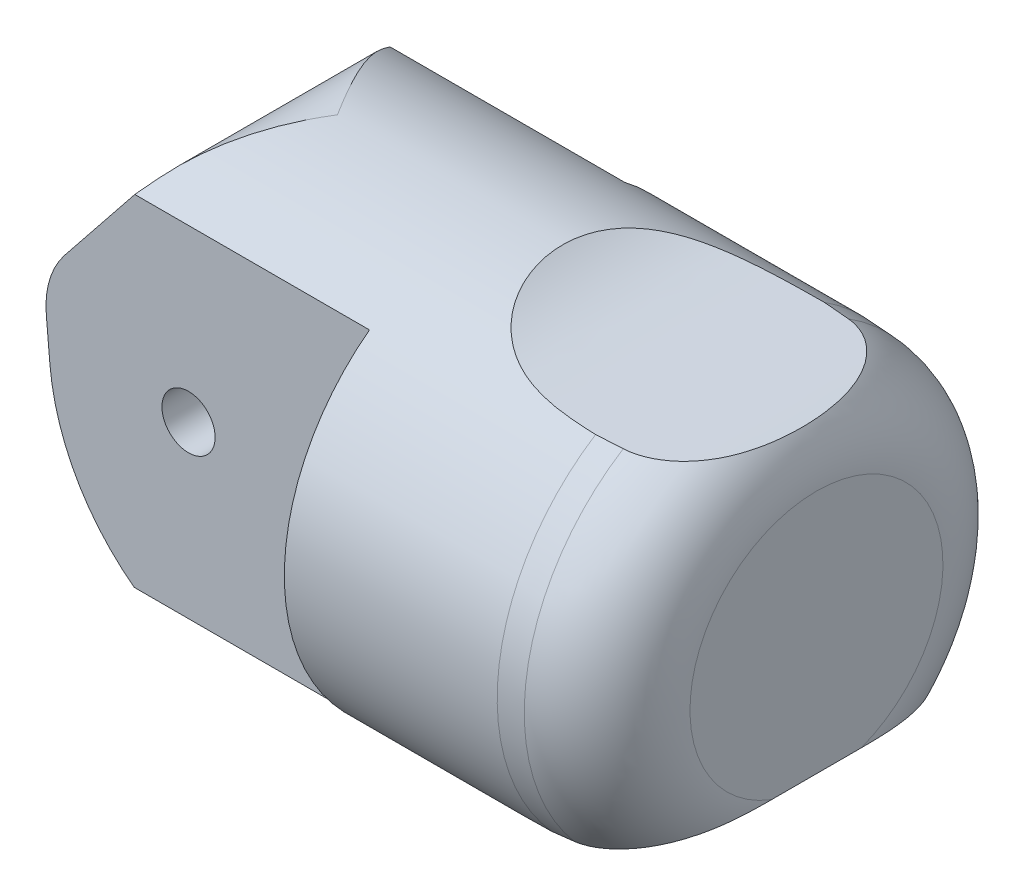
ISO-10303-21;
HEADER;
FILE_DESCRIPTION(('STEP AP214'),'2;1');
FILE_NAME('part.step','',(''),(''),'','','');
FILE_SCHEMA(('AUTOMOTIVE_DESIGN { 1 0 10303 214 1 1 1 1 }'));
ENDSEC;
DATA;
#1=APPLICATION_CONTEXT('core data for automotive mechanical design processes');
#2=APPLICATION_PROTOCOL_DEFINITION('international standard','automotive_design',2000,#1);
#3=PRODUCT_CONTEXT('',#1,'mechanical');
#4=PRODUCT('Part','Part','',(#3));
#5=PRODUCT_RELATED_PRODUCT_CATEGORY('part','',(#4));
#6=PRODUCT_DEFINITION_FORMATION('','',#4);
#7=PRODUCT_DEFINITION_CONTEXT('part definition',#1,'design');
#8=PRODUCT_DEFINITION('design','',#6,#7);
#9=PRODUCT_DEFINITION_SHAPE('','',#8);
#10=(LENGTH_UNIT() NAMED_UNIT(*) SI_UNIT(.MILLI.,.METRE.));
#11=(NAMED_UNIT(*) PLANE_ANGLE_UNIT() SI_UNIT($,.RADIAN.));
#12=(NAMED_UNIT(*) SI_UNIT($,.STERADIAN.) SOLID_ANGLE_UNIT());
#13=UNCERTAINTY_MEASURE_WITH_UNIT(LENGTH_MEASURE(1.E-05),#10,'distance_accuracy_value','');
#14=(GEOMETRIC_REPRESENTATION_CONTEXT(3) GLOBAL_UNCERTAINTY_ASSIGNED_CONTEXT((#13)) GLOBAL_UNIT_ASSIGNED_CONTEXT((#10,
#11,#12)) REPRESENTATION_CONTEXT('',''));
#15=CARTESIAN_POINT('',(0.,0.,0.));
#16=DIRECTION('',(0.,0.,1.));
#17=DIRECTION('',(1.,0.,0.));
#18=AXIS2_PLACEMENT_3D('',#15,#16,#17);
#19=CARTESIAN_POINT('',(-12.9467628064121,-1.13269497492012,0.));
#20=DIRECTION('',(-0.996194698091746,-0.087155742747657,0.));
#21=DIRECTION('',(0.087155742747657,-0.996194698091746,0.));
#22=AXIS2_PLACEMENT_3D('',#19,#20,#21);
#23=PLANE('',#22);
#24=DIRECTION('',(0.087155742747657,-0.996194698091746,0.));
#25=VECTOR('',#24,1.);
#26=CARTESIAN_POINT('',(-13.7271614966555,7.78730287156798,-3.));
#27=LINE('',#26,#25);
#28=CARTESIAN_POINT('',(-13.7271614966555,7.78730287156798,-3.));
#29=VERTEX_POINT('',#28);
#30=CARTESIAN_POINT('',(-12.5069810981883,-6.15942290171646,-3.));
#31=VERTEX_POINT('',#30);
#32=EDGE_CURVE('E297',#29,#31,#27,.T.);
#33=ORIENTED_EDGE('',*,*,#32,.T.);
#34=DIRECTION('',(0.,0.,1.));
#35=VECTOR('',#34,1.);
#36=CARTESIAN_POINT('',(-12.5069810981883,-6.15942290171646,-3.));
#37=LINE('',#36,#35);
#38=CARTESIAN_POINT('',(-12.5069810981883,-6.15942290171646,3.));
#39=VERTEX_POINT('',#38);
#40=EDGE_CURVE('E300',#31,#39,#37,.T.);
#41=ORIENTED_EDGE('',*,*,#40,.T.);
#42=DIRECTION('',(-0.087155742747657,0.996194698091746,0.));
#43=VECTOR('',#42,1.);
#44=CARTESIAN_POINT('',(-13.7271614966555,7.78730287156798,3.));
#45=LINE('',#44,#43);
#46=CARTESIAN_POINT('',(-13.7271614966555,7.78730287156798,3.));
#47=VERTEX_POINT('',#46);
#48=EDGE_CURVE('E304',#39,#47,#45,.T.);
#49=ORIENTED_EDGE('',*,*,#48,.T.);
#50=DIRECTION('',(0.,0.,-1.));
#51=VECTOR('',#50,1.);
#52=CARTESIAN_POINT('',(-13.7271614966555,7.78730287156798,-3.));
#53=LINE('',#52,#51);
#54=EDGE_CURVE('E307',#47,#29,#53,.T.);
#55=ORIENTED_EDGE('',*,*,#54,.T.);
#56=EDGE_LOOP('',(#33,#41,#49,#55));
#57=FACE_BOUND('',#56,.T.);
#58=DIRECTION('',(0.087155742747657,-0.996194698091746,0.));
#59=VECTOR('',#58,1.);
#60=CARTESIAN_POINT('',(-12.2760211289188,-8.7993074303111,2.));
#61=LINE('',#60,#59);
#62=CARTESIAN_POINT('',(-13.5407713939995,5.65685424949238,2.));
#63=VERTEX_POINT('',#62);
#64=CARTESIAN_POINT('',(-12.5759361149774,-5.37126345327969,2.));
#65=VERTEX_POINT('',#64);
#66=EDGE_CURVE('E289',#63,#65,#61,.T.);
#67=ORIENTED_EDGE('',*,*,#66,.T.);
#68=DIRECTION('',(0.,0.,-1.));
#69=VECTOR('',#68,1.);
#70=CARTESIAN_POINT('',(-12.5759361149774,-5.37126345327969,0.));
#71=LINE('',#70,#69);
#72=CARTESIAN_POINT('',(-12.5759361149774,-5.37126345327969,-2.));
#73=VERTEX_POINT('',#72);
#74=EDGE_CURVE('E293',#65,#73,#71,.T.);
#75=ORIENTED_EDGE('',*,*,#74,.T.);
#76=DIRECTION('',(0.087155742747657,-0.996194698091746,0.));
#77=VECTOR('',#76,1.);
#78=CARTESIAN_POINT('',(-12.2760211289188,-8.7993074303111,-2.));
#79=LINE('',#78,#77);
#80=CARTESIAN_POINT('',(-13.5407713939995,5.65685424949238,-2.));
#81=VERTEX_POINT('',#80);
#82=EDGE_CURVE('E287',#81,#73,#79,.T.);
#83=ORIENTED_EDGE('',*,*,#82,.F.);
#84=CARTESIAN_POINT('',(-13.0458607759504,0.,0.));
#85=DIRECTION('',(-0.996194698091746,-0.087155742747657,0.));
#86=DIRECTION('',(0.087155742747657,-0.996194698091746,0.));
#87=AXIS2_PLACEMENT_3D('',#84,#85,#86);
#88=ELLIPSE('',#87,6.02291902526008,6.);
#89=EDGE_CURVE('E65',#63,#81,#88,.T.);
#90=ORIENTED_EDGE('',*,*,#89,.F.);
#91=EDGE_LOOP('',(#67,#75,#83,#90));
#92=FACE_BOUND('',#91,.T.);
#93=ADVANCED_FACE('F49',(#57,#92),#23,.T.);
#94=CARTESIAN_POINT('',(-18.5,0.,-10.));
#95=DIRECTION('',(0.,0.,1.));
#96=DIRECTION('',(1.,0.,0.));
#97=AXIS2_PLACEMENT_3D('',#94,#95,#96);
#98=CYLINDRICAL_SURFACE('',#97,1.25);
#99=CARTESIAN_POINT('',(-18.5,0.,-3.));
#100=DIRECTION('',(0.,0.,-1.));
#101=DIRECTION('',(0.,1.,0.));
#102=AXIS2_PLACEMENT_3D('',#99,#100,#101);
#103=CIRCLE('',#102,1.25);
#104=CARTESIAN_POINT('',(-18.5,1.25,-3.));
#105=VERTEX_POINT('',#104);
#106=EDGE_CURVE('E334',#105,#105,#103,.F.);
#107=ORIENTED_EDGE('',*,*,#106,.T.);
#108=EDGE_LOOP('',(#107));
#109=FACE_BOUND('',#108,.T.);
#110=CARTESIAN_POINT('',(-18.5,0.,-6.));
#111=DIRECTION('',(0.,0.,1.));
#112=DIRECTION('',(1.,0.,0.));
#113=AXIS2_PLACEMENT_3D('',#110,#111,#112);
#114=CIRCLE('',#113,1.25);
#115=CARTESIAN_POINT('',(-17.25,0.,-6.));
#116=VERTEX_POINT('',#115);
#117=EDGE_CURVE('E474',#116,#116,#114,.T.);
#118=ORIENTED_EDGE('',*,*,#117,.F.);
#119=EDGE_LOOP('',(#118));
#120=FACE_BOUND('',#119,.T.);
#121=ADVANCED_FACE('F425',(#109,#120),#98,.F.);
#122=CARTESIAN_POINT('',(-25.1817611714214,1.0294173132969,-10.));
#123=DIRECTION('',(-0.996194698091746,-0.0871557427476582,0.));
#124=DIRECTION('',(0.0871557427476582,-0.996194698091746,0.));
#125=AXIS2_PLACEMENT_3D('',#122,#123,#124);
#126=PLANE('',#125);
#127=DIRECTION('',(0.087155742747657,-0.996194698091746,0.));
#128=VECTOR('',#127,1.);
#129=CARTESIAN_POINT('',(-25.6814978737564,6.74143395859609,-3.));
#130=LINE('',#129,#128);
#131=CARTESIAN_POINT('',(-25.1817611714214,1.02941731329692,-3.));
#132=VERTEX_POINT('',#131);
#133=CARTESIAN_POINT('',(-25.0154474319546,-0.87155742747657,-3.));
#134=VERTEX_POINT('',#133);
#135=EDGE_CURVE('E296',#132,#134,#130,.T.);
#136=ORIENTED_EDGE('',*,*,#135,.F.);
#137=DIRECTION('',(0.,0.,1.));
#138=VECTOR('',#137,1.);
#139=CARTESIAN_POINT('',(-25.1817611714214,1.0294173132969,-10.));
#140=LINE('',#139,#138);
#141=CARTESIAN_POINT('',(-25.1817611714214,1.0294173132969,-6.));
#142=VERTEX_POINT('',#141);
#143=EDGE_CURVE('E604',#142,#132,#140,.T.);
#144=ORIENTED_EDGE('',*,*,#143,.F.);
#145=DIRECTION('',(0.0871557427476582,-0.996194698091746,0.));
#146=VECTOR('',#145,1.);
#147=CARTESIAN_POINT('',(-24.2303575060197,-9.84517634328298,-6.));
#148=LINE('',#147,#146);
#149=CARTESIAN_POINT('',(-25.0154474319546,-0.871557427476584,-6.));
#150=VERTEX_POINT('',#149);
#151=EDGE_CURVE('E492',#142,#150,#148,.T.);
#152=ORIENTED_EDGE('',*,*,#151,.T.);
#153=DIRECTION('',(0.,0.,1.));
#154=VECTOR('',#153,1.);
#155=CARTESIAN_POINT('',(-25.0154474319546,-0.871557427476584,-10.));
#156=LINE('',#155,#154);
#157=EDGE_CURVE('E380',#150,#134,#156,.T.);
#158=ORIENTED_EDGE('',*,*,#157,.T.);
#159=EDGE_LOOP('',(#136,#144,#152,#158));
#160=FACE_BOUND('',#159,.T.);
#161=ADVANCED_FACE('F444',(#160),#126,.T.);
#162=CARTESIAN_POINT('',(-21.1969823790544,1.37804028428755,-10.));
#163=DIRECTION('',(0.,0.,1.));
#164=DIRECTION('',(1.,0.,0.));
#165=AXIS2_PLACEMENT_3D('',#162,#163,#164);
#166=CYLINDRICAL_SURFACE('',#165,4.);
#167=CARTESIAN_POINT('',(-21.1969823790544,1.37804028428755,-3.));
#168=DIRECTION('',(0.,0.,-1.));
#169=DIRECTION('',(0.,1.,0.));
#170=AXIS2_PLACEMENT_3D('',#167,#168,#169);
#171=CIRCLE('',#170,4.);
#172=CARTESIAN_POINT('',(-24.3210892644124,3.87603071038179,-3.));
#173=VERTEX_POINT('',#172);
#174=EDGE_CURVE('E330',#173,#132,#171,.F.);
#175=ORIENTED_EDGE('',*,*,#174,.F.);
#176=DIRECTION('',(0.,0.,1.));
#177=VECTOR('',#176,1.);
#178=CARTESIAN_POINT('',(-24.3210892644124,3.87603071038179,-10.));
#179=LINE('',#178,#177);
#180=CARTESIAN_POINT('',(-24.3210892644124,3.87603071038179,-6.));
#181=VERTEX_POINT('',#180);
#182=EDGE_CURVE('E512',#181,#173,#179,.T.);
#183=ORIENTED_EDGE('',*,*,#182,.F.);
#184=CARTESIAN_POINT('',(-21.1969823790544,1.37804028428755,-6.));
#185=DIRECTION('',(0.,0.,1.));
#186=DIRECTION('',(1.,0.,0.));
#187=AXIS2_PLACEMENT_3D('',#184,#185,#186);
#188=CIRCLE('',#187,4.);
#189=EDGE_CURVE('E490',#181,#142,#188,.T.);
#190=ORIENTED_EDGE('',*,*,#189,.T.);
#191=ORIENTED_EDGE('',*,*,#143,.T.);
#192=EDGE_LOOP('',(#175,#183,#190,#191));
#193=FACE_BOUND('',#192,.T.);
#194=ADVANCED_FACE('F601',(#193),#166,.T.);
#195=CARTESIAN_POINT('',(0.,0.,0.));
#196=DIRECTION('',(-1.,0.,0.));
#197=DIRECTION('',(0.,0.,-1.));
#198=AXIS2_PLACEMENT_3D('',#195,#196,#197);
#199=CONICAL_SURFACE('',#198,10.,0.0523598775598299);
#200=CARTESIAN_POINT('',(20.5237115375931,-2.10108382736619,0.));
#201=DIRECTION('',(-0.217284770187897,0.976108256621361,0.));
#202=DIRECTION('',(-0.976108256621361,-0.217284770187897,0.));
#203=AXIS2_PLACEMENT_3D('',#200,#201,#202);
#204=ELLIPSE('',#203,41.0723579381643,8.67354159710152);
#205=CARTESIAN_POINT('',(0.,-6.66972661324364,7.45082189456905));
#206=VERTEX_POINT('',#205);
#207=CARTESIAN_POINT('',(1.20934382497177,-6.40052287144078,7.60064098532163));
#208=VERTEX_POINT('',#207);
#209=EDGE_CURVE('E555',#206,#208,#204,.T.);
#210=ORIENTED_EDGE('',*,*,#209,.T.);
#211=CARTESIAN_POINT('',(1.20934382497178,0.,0.));
#212=DIRECTION('',(-1.,0.,0.));
#213=DIRECTION('',(0.,0.,1.));
#214=AXIS2_PLACEMENT_3D('',#211,#212,#213);
#215=CIRCLE('',#214,9.93662097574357);
#216=CARTESIAN_POINT('',(1.20934382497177,8.41378910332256,5.28626421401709));
#217=VERTEX_POINT('',#216);
#218=EDGE_CURVE('E578',#208,#217,#215,.T.);
#219=ORIENTED_EDGE('',*,*,#218,.T.);
#220=CARTESIAN_POINT('',(5.00000000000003,8.0642740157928,5.45851363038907));
#221=CARTESIAN_POINT('',(4.87808491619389,8.08946899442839,5.43267580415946));
#222=CARTESIAN_POINT('',(4.75530297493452,8.11285778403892,5.40926833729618));
#223=CARTESIAN_POINT('',(4.50868024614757,8.15625011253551,5.36717130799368));
#224=CARTESIAN_POINT('',(4.38484310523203,8.17626241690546,5.34846946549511));
#225=CARTESIAN_POINT('',(4.13629410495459,8.2132355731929,5.31552738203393));
#226=CARTESIAN_POINT('',(4.01158353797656,8.23020022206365,5.30128157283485));
#227=CARTESIAN_POINT('',(3.76145454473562,8.26137163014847,5.27696495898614));
#228=CARTESIAN_POINT('',(3.63603633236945,8.27557918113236,5.26689295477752));
#229=CARTESIAN_POINT('',(3.38564256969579,8.30139993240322,5.25069026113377));
#230=CARTESIAN_POINT('',(3.26067079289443,8.31303185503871,5.24453047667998));
#231=CARTESIAN_POINT('',(3.01036113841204,8.33407600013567,5.23572606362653));
#232=CARTESIAN_POINT('',(2.8850231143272,8.34348715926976,5.23308311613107));
#233=CARTESIAN_POINT('',(2.63414562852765,8.36031076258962,5.23099371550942));
#234=CARTESIAN_POINT('',(2.50860611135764,8.36772250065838,5.23154839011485));
#235=CARTESIAN_POINT('',(2.25749140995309,8.38073992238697,5.23555117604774));
#236=CARTESIAN_POINT('',(2.13191622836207,8.38634571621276,5.23899911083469));
#237=CARTESIAN_POINT('',(1.89504707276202,8.39552354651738,5.24773707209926));
#238=CARTESIAN_POINT('',(1.78374929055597,8.3992541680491,5.25277371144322));
#239=CARTESIAN_POINT('',(1.56123412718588,8.40579271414,5.26430784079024));
#240=CARTESIAN_POINT('',(1.45001673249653,8.4086008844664,5.27080494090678));
#241=CARTESIAN_POINT('',(1.22764146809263,8.41353132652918,5.28487389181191));
#242=CARTESIAN_POINT('',(1.1164835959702,8.41565362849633,5.29244569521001));
#243=CARTESIAN_POINT('',(0.8936124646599,8.41945826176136,5.30832400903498));
#244=CARTESIAN_POINT('',(0.781899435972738,8.42113816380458,5.31663425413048));
#245=CARTESIAN_POINT('',(0.558491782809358,8.42428118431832,5.33357252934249));
#246=CARTESIAN_POINT('',(0.446797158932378,8.42574429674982,5.34220056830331));
#247=CARTESIAN_POINT('',(0.223406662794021,8.42869333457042,5.3593979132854));
#248=CARTESIAN_POINT('',(0.111710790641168,8.43017925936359,5.36796722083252));
#249=CARTESIAN_POINT('',(0.,8.43179644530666,5.3763192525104));
#250=B_SPLINE_CURVE_WITH_KNOTS('',3,(#220,#221,#222,#223,#224,#225,#226,#227,#228,#229,#230,
#231,#232,#233,#234,#235,#236,#237,#238,#239,#240,#241,#242,#243,#244,#245,#246,#247,#248,#249),
.UNSPECIFIED.,.F.,.F.,(4,2,2,2,2,2,2,2,2,2,2,2,2,2,4),(0.,0.381363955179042,0.76172211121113,
1.14160305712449,1.52137474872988,1.89828796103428,2.27538127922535,2.65260759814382,
3.02981090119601,3.36421706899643,3.69853406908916,4.03283633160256,4.36893770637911,
4.70504844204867,5.04115041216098),.UNSPECIFIED.);
#251=CARTESIAN_POINT('',(0.,8.43179644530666,5.3763192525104));
#252=VERTEX_POINT('',#251);
#253=EDGE_CURVE('E368',#217,#252,#250,.T.);
#254=ORIENTED_EDGE('',*,*,#253,.T.);
#255=CARTESIAN_POINT('',(0.,0.,0.));
#256=DIRECTION('',(1.,0.,0.));
#257=DIRECTION('',(0.,0.,-1.));
#258=AXIS2_PLACEMENT_3D('',#255,#256,#257);
#259=CIRCLE('',#258,10.);
#260=EDGE_CURVE('E546',#252,#206,#259,.T.);
#261=ORIENTED_EDGE('',*,*,#260,.T.);
#262=EDGE_LOOP('',(#210,#219,#254,#261));
#263=FACE_BOUND('',#262,.T.);
#264=ADVANCED_FACE('F387',(#263),#199,.T.);
#265=CARTESIAN_POINT('',(-26.,0.,0.));
#266=DIRECTION('',(1.,0.,0.));
#267=DIRECTION('',(0.,0.,-1.));
#268=AXIS2_PLACEMENT_3D('',#265,#266,#267);
#269=CYLINDRICAL_SURFACE('',#268,10.);
#270=CARTESIAN_POINT('',(0.,8.43179644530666,-5.3763192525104));
#271=CARTESIAN_POINT('',(-0.179571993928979,8.43440127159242,-5.37222534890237));
#272=CARTESIAN_POINT('',(-0.359163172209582,8.43733847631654,-5.36761974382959));
#273=CARTESIAN_POINT('',(-0.719429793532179,8.44494057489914,-5.35565654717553));
#274=CARTESIAN_POINT('',(-0.90010434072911,8.44961703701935,-5.34828052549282));
#275=CARTESIAN_POINT('',(-1.26159895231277,8.4617688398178,-5.32903316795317));
#276=CARTESIAN_POINT('',(-1.4424182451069,8.46925117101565,-5.31715060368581));
#277=CARTESIAN_POINT('',(-1.80857991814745,8.48837590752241,-5.28656972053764));
#278=CARTESIAN_POINT('',(-1.99390168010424,8.50013248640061,-5.26768402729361));
#279=CARTESIAN_POINT('',(-2.36262963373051,8.52888778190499,-5.22099885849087));
#280=CARTESIAN_POINT('',(-2.54603919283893,8.5458746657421,-5.19321949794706));
#281=CARTESIAN_POINT('',(-2.90990236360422,8.58611218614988,-5.12642325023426));
#282=CARTESIAN_POINT('',(-3.09036000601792,8.60935336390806,-5.0874233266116));
#283=CARTESIAN_POINT('',(-3.39969764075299,8.65577693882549,-5.00789669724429));
#284=CARTESIAN_POINT('',(-3.52961781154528,8.67735527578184,-4.97049076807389));
#285=CARTESIAN_POINT('',(-3.78612574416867,8.72443044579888,-4.88739205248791));
#286=CARTESIAN_POINT('',(-3.91271260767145,8.74992832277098,-4.84169705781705));
#287=CARTESIAN_POINT('',(-4.16048082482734,8.80454398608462,-4.74164798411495));
#288=CARTESIAN_POINT('',(-4.28169574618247,8.83363302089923,-4.68736181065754));
#289=CARTESIAN_POINT('',(-4.5185486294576,8.89524054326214,-4.5693677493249));
#290=CARTESIAN_POINT('',(-4.6341871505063,8.92775868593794,-4.50566080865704));
#291=CARTESIAN_POINT('',(-4.85994815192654,8.9959929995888,-4.36784616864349));
#292=CARTESIAN_POINT('',(-4.96999737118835,9.03173997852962,-4.29363334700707));
#293=CARTESIAN_POINT('',(-5.18213144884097,9.10525604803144,-4.13544579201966));
#294=CARTESIAN_POINT('',(-5.28421602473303,9.14302521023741,-4.05147071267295));
#295=CARTESIAN_POINT('',(-5.4797543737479,9.21961154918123,-3.87403061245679));
#296=CARTESIAN_POINT('',(-5.57319015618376,9.25843070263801,-3.78054662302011));
#297=CARTESIAN_POINT('',(-5.75062153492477,9.33590444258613,-3.58496086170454));
#298=CARTESIAN_POINT('',(-5.83461740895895,9.37455903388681,-3.4828593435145));
#299=CARTESIAN_POINT('',(-5.98585093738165,9.44720021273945,-3.28038532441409));
#300=CARTESIAN_POINT('',(-6.05391459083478,9.48129625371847,-3.18066631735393));
#301=CARTESIAN_POINT('',(-6.18197726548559,9.54765400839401,-2.9755542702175));
#302=CARTESIAN_POINT('',(-6.24197353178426,9.57991509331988,-2.87015930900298));
#303=CARTESIAN_POINT('',(-6.35395117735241,9.64188901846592,-2.65453495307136));
#304=CARTESIAN_POINT('',(-6.40593528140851,9.67160272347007,-2.5443072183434));
#305=CARTESIAN_POINT('',(-6.50209698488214,9.72791272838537,-2.31972405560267));
#306=CARTESIAN_POINT('',(-6.54627378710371,9.75450870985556,-2.20536820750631));
#307=CARTESIAN_POINT('',(-6.63057792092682,9.80627679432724,-1.96305814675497));
#308=CARTESIAN_POINT('',(-6.67000956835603,9.83111906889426,-1.8347913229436));
#309=CARTESIAN_POINT('',(-6.74015766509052,9.87604738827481,-1.57513392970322));
#310=CARTESIAN_POINT('',(-6.77087670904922,9.89613484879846,-1.44374430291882));
#311=CARTESIAN_POINT('',(-6.82389031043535,9.93121440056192,-1.17851078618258));
#312=CARTESIAN_POINT('',(-6.84617882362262,9.94620283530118,-1.04466520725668));
#313=CARTESIAN_POINT('',(-6.88249644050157,9.97080795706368,-0.775412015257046));
#314=CARTESIAN_POINT('',(-6.89652766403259,9.98042602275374,-0.6400048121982));
#315=CARTESIAN_POINT('',(-6.91773021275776,9.99500367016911,-0.351206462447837));
#316=CARTESIAN_POINT('',(-6.92381585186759,9.99922455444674,-0.197696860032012));
#317=CARTESIAN_POINT('',(-6.92577505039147,10.0005806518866,0.109426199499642));
#318=CARTESIAN_POINT('',(-6.92164778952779,9.99771529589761,0.263039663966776));
#319=CARTESIAN_POINT('',(-6.90312209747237,9.98495075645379,0.56946105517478));
#320=CARTESIAN_POINT('',(-6.88871672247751,9.97504681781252,0.722268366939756));
#321=CARTESIAN_POINT('',(-6.84945228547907,9.94840125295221,1.02593556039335));
#322=CARTESIAN_POINT('',(-6.82459319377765,9.93165960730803,1.17679543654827));
#323=CARTESIAN_POINT('',(-6.76305834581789,9.89098411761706,1.4808019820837));
#324=CARTESIAN_POINT('',(-6.72599368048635,9.86681560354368,1.63383908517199));
#325=CARTESIAN_POINT('',(-6.6399299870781,9.8121247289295,1.93537755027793));
#326=CARTESIAN_POINT('',(-6.59093033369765,9.78160203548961,2.08387867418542));
#327=CARTESIAN_POINT('',(-6.4805866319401,9.71506517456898,2.37481706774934));
#328=CARTESIAN_POINT('',(-6.41925291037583,9.67905560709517,2.51725929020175));
#329=CARTESIAN_POINT('',(-6.28380763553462,9.60262326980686,2.79469512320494));
#330=CARTESIAN_POINT('',(-6.20969794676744,9.56220114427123,2.92968981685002));
#331=CARTESIAN_POINT('',(-6.05553605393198,9.48199205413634,3.17922559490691));
#332=CARTESIAN_POINT('',(-5.97657434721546,9.44246005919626,3.29452228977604));
#333=CARTESIAN_POINT('',(-5.8078686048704,9.36207822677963,3.51644972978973));
#334=CARTESIAN_POINT('',(-5.71812548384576,9.32122850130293,3.62308120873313));
#335=CARTESIAN_POINT('',(-5.52833443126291,9.23958042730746,3.8265074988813));
#336=CARTESIAN_POINT('',(-5.42829913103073,9.1987820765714,3.92331408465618));
#337=CARTESIAN_POINT('',(-5.21856606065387,9.11851138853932,4.10642813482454));
#338=CARTESIAN_POINT('',(-5.10886921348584,9.07903892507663,4.19273660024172));
#339=CARTESIAN_POINT('',(-4.89551016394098,9.00751033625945,4.34405818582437));
#340=CARTESIAN_POINT('',(-4.79287422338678,8.97515181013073,4.41038298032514));
#341=CARTESIAN_POINT('',(-4.58196329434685,8.91298687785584,4.53469914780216));
#342=CARTESIAN_POINT('',(-4.47368890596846,8.88318020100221,4.59269140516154));
#343=CARTESIAN_POINT('',(-4.25245018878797,8.82657599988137,4.70056073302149));
#344=CARTESIAN_POINT('',(-4.13948648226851,8.79977807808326,4.75043887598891));
#345=CARTESIAN_POINT('',(-3.90976255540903,8.74943215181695,4.84253877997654));
#346=CARTESIAN_POINT('',(-3.79300115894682,8.72588516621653,4.88475814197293));
#347=CARTESIAN_POINT('',(-3.48086703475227,8.66812634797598,4.98687924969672));
#348=CARTESIAN_POINT('',(-3.28300634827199,8.63673326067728,5.04080578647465));
#349=CARTESIAN_POINT('',(-2.88248773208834,8.58240116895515,5.13275845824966));
#350=CARTESIAN_POINT('',(-2.67982617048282,8.55946879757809,5.17077212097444));
#351=CARTESIAN_POINT('',(-2.27092812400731,8.52074264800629,5.23434089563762));
#352=CARTESIAN_POINT('',(-2.06467891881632,8.50498472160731,5.25983348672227));
#353=CARTESIAN_POINT('',(-1.65097688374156,8.47922215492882,5.30126100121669));
#354=CARTESIAN_POINT('',(-1.44352433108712,8.46921623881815,5.3171980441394));
#355=CARTESIAN_POINT('',(-1.02924276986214,8.45334582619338,5.34239355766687));
#356=CARTESIAN_POINT('',(-0.822416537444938,8.44745902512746,5.3516880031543));
#357=CARTESIAN_POINT('',(-0.410377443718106,8.43818440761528,5.36628973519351));
#358=CARTESIAN_POINT('',(-0.205166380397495,8.4347750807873,5.37163134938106));
#359=CARTESIAN_POINT('',(0.,8.43179644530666,5.3763192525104));
#360=B_SPLINE_CURVE_WITH_KNOTS('',3,(#270,#271,#272,#273,#274,#275,#276,#277,#278,#279,#280,
#281,#282,#283,#284,#285,#286,#287,#288,#289,#290,#291,#292,#293,#294,#295,#296,#297,#298,#299,
#300,#301,#302,#303,#304,#305,#306,#307,#308,#309,#310,#311,#312,#313,#314,#315,#316,#317,#318,
#319,#320,#321,#322,#323,#324,#325,#326,#327,#328,#329,#330,#331,#332,#333,#334,#335,#336,#337,
#338,#339,#340,#341,#342,#343,#344,#345,#346,#347,#348,#349,#350,#351,#352,#353,#354,#355,#356,
#357,#358,#359),.UNSPECIFIED.,.F.,.F.,(4,2,2,2,2,2,2,2,2,2,2,2,2,2,2,2,2,2,2,2,2,2,2,2,2,2,2,2,
2,2,2,2,2,2,2,2,2,2,2,2,2,2,2,2,4),(0.,0.538968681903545,1.08158823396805,1.62556874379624,
2.18529900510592,2.74377215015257,3.30140537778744,3.71183433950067,4.12237280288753,
4.52981500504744,4.93721626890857,5.34902761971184,5.76085357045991,6.17351778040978,
6.58616984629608,6.96213026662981,7.33821874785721,7.71417904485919,8.09017770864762,
8.49917595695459,8.9080522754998,9.31722118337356,9.72628500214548,10.186834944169,
10.6474218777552,11.1083202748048,11.5692199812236,12.0465158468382,12.5238367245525,
13.0007596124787,13.4776129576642,13.9126628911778,14.3476759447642,14.7821613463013,
15.2166052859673,15.5954123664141,15.9741792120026,16.3528959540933,16.7317311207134,
17.3530091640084,17.974773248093,18.5996111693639,19.2243104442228,19.8456003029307,
20.4614292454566),.UNSPECIFIED.);
#361=CARTESIAN_POINT('',(0.,8.43179644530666,-5.37631925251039));
#362=VERTEX_POINT('',#361);
#363=EDGE_CURVE('E373',#362,#252,#360,.T.);
#364=ORIENTED_EDGE('',*,*,#363,.F.);
#365=CARTESIAN_POINT('',(0.,-6.66972661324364,-7.45082189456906));
#366=VERTEX_POINT('',#365);
#367=EDGE_CURVE('E544',#366,#362,#259,.T.);
#368=ORIENTED_EDGE('',*,*,#367,.F.);
#369=CARTESIAN_POINT('',(29.962409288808,0.,0.));
#370=DIRECTION('',(-0.217284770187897,0.976108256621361,0.));
#371=DIRECTION('',(0.976108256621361,0.217284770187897,0.));
#372=AXIS2_PLACEMENT_3D('',#369,#370,#371);
#373=ELLIPSE('',#372,46.0225536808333,10.);
#374=EDGE_CURVE('E561',#206,#366,#373,.F.);
#375=ORIENTED_EDGE('',*,*,#374,.F.);
#376=ORIENTED_EDGE('',*,*,#260,.F.);
#377=EDGE_LOOP('',(#364,#368,#375,#376));
#378=FACE_BOUND('',#377,.T.);
#379=CARTESIAN_POINT('',(-20.6254375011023,8.49799042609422,-5.27106808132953));
#380=CARTESIAN_POINT('',(-20.5671299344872,8.57090207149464,-5.15351552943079));
#381=CARTESIAN_POINT('',(-20.5069495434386,8.64094458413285,-5.03515302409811));
#382=CARTESIAN_POINT('',(-20.383270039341,8.775387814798,-4.79700674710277));
#383=CARTESIAN_POINT('',(-20.3197716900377,8.83978982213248,-4.67722330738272));
#384=CARTESIAN_POINT('',(-20.125051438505,9.02458249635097,-4.31624190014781));
#385=CARTESIAN_POINT('',(-19.9894649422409,9.13673112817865,-4.0731349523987));
#386=CARTESIAN_POINT('',(-19.7099064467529,9.33944937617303,-3.58393723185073));
#387=CARTESIAN_POINT('',(-19.5659598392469,9.4300804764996,-3.33785712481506));
#388=CARTESIAN_POINT('',(-19.2715161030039,9.59090208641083,-2.84293751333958));
#389=CARTESIAN_POINT('',(-19.1210178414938,9.66108904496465,-2.59409753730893));
#390=CARTESIAN_POINT('',(-18.7326227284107,9.81419386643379,-1.95922729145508));
#391=CARTESIAN_POINT('',(-18.4915045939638,9.88344555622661,-1.57183121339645));
#392=CARTESIAN_POINT('',(-18.004219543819,9.97599229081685,-0.795177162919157));
#393=CARTESIAN_POINT('',(-17.7580573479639,9.99932847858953,-0.405921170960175));
#394=CARTESIAN_POINT('',(-17.5084575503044,9.99999523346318,-0.0112686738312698));
#395=CARTESIAN_POINT('',(-17.5048940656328,9.99999999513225,-0.00563430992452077));
#396=CARTESIAN_POINT('',(-17.5013306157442,10.,0.));
#397=B_SPLINE_CURVE_WITH_KNOTS('',3,(#379,#380,#381,#382,#383,#384,#385,#386,#387,#388,#389,
#390,#391,#392,#393,#394,#395,#396),.UNSPECIFIED.,.F.,.F.,(4,2,2,2,2,2,2,2,4),(0.,
0.450248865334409,0.900394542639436,1.79962462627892,2.69625346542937,3.59303795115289,
4.97514175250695,6.35600654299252,6.37600654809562),.UNSPECIFIED.);
#398=CARTESIAN_POINT('',(-20.6254375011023,8.49799042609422,-5.27106808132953));
#399=VERTEX_POINT('',#398);
#400=CARTESIAN_POINT('',(-17.5013306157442,10.,0.));
#401=VERTEX_POINT('',#400);
#402=EDGE_CURVE('E393',#399,#401,#397,.T.);
#403=ORIENTED_EDGE('',*,*,#402,.T.);
#404=CARTESIAN_POINT('',(-20.6254375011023,8.49799042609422,5.27106808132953));
#405=CARTESIAN_POINT('',(-20.5671299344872,8.57090207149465,5.15351552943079));
#406=CARTESIAN_POINT('',(-20.5069495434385,8.64094458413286,5.03515302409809));
#407=CARTESIAN_POINT('',(-20.383270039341,8.77538781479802,4.79700674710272));
#408=CARTESIAN_POINT('',(-20.3197716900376,8.83978982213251,4.67722330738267));
#409=CARTESIAN_POINT('',(-20.125051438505,9.02458249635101,4.31624190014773));
#410=CARTESIAN_POINT('',(-19.9894649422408,9.1367311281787,4.07313495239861));
#411=CARTESIAN_POINT('',(-19.7099064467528,9.33944937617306,3.58393723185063));
#412=CARTESIAN_POINT('',(-19.5659598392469,9.43008047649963,3.33785712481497));
#413=CARTESIAN_POINT('',(-19.2715161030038,9.59090208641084,2.84293751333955));
#414=CARTESIAN_POINT('',(-19.1210178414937,9.66108904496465,2.59409753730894));
#415=CARTESIAN_POINT('',(-18.7326227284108,9.81419386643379,1.95922729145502));
#416=CARTESIAN_POINT('',(-18.4915045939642,9.88344555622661,1.57183121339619));
#417=CARTESIAN_POINT('',(-18.0042195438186,9.97599229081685,0.795177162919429));
#418=CARTESIAN_POINT('',(-17.7580573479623,9.99932847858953,0.405921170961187));
#419=CARTESIAN_POINT('',(-17.5084575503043,9.99999523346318,0.0112686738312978));
#420=CARTESIAN_POINT('',(-17.5048940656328,9.99999999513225,0.00563430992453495));
#421=CARTESIAN_POINT('',(-17.5013306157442,10.,0.));
#422=B_SPLINE_CURVE_WITH_KNOTS('',3,(#404,#405,#406,#407,#408,#409,#410,#411,#412,#413,#414,
#415,#416,#417,#418,#419,#420,#421),.UNSPECIFIED.,.F.,.F.,(4,2,2,2,2,2,2,2,4),(0.,
0.450248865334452,0.900394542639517,1.79962462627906,2.69625346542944,3.59303795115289,
4.97514175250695,6.35600654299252,6.37600654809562),.UNSPECIFIED.);
#423=CARTESIAN_POINT('',(-20.6254375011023,8.49799042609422,5.27106808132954));
#424=VERTEX_POINT('',#423);
#425=EDGE_CURVE('E400',#401,#424,#422,.F.);
#426=ORIENTED_EDGE('',*,*,#425,.T.);
#427=CARTESIAN_POINT('',(-27.4203070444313,0.,0.));
#428=DIRECTION('',(-0.781026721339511,0.624497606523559,0.));
#429=DIRECTION('',(0.624497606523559,0.781026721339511,0.));
#430=AXIS2_PLACEMENT_3D('',#427,#428,#429);
#431=ELLIPSE('',#430,12.8036592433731,10.);
#432=CARTESIAN_POINT('',(-21.0236234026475,8.,6.));
#433=VERTEX_POINT('',#432);
#434=EDGE_CURVE('E509',#424,#433,#431,.F.);
#435=ORIENTED_EDGE('',*,*,#434,.T.);
#436=DIRECTION('',(1.,0.,0.));
#437=VECTOR('',#436,1.);
#438=CARTESIAN_POINT('',(-26.,8.,6.));
#439=LINE('',#438,#437);
#440=CARTESIAN_POINT('',(-10.,8.,6.));
#441=VERTEX_POINT('',#440);
#442=EDGE_CURVE('E539',#433,#441,#439,.T.);
#443=ORIENTED_EDGE('',*,*,#442,.T.);
#444=CARTESIAN_POINT('',(-9.99999999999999,0.,0.));
#445=DIRECTION('',(1.,0.,0.));
#446=DIRECTION('',(0.,0.,-1.));
#447=AXIS2_PLACEMENT_3D('',#444,#445,#446);
#448=CIRCLE('',#447,10.);
#449=CARTESIAN_POINT('',(-10.,-8.,6.));
#450=VERTEX_POINT('',#449);
#451=EDGE_CURVE('E547',#450,#441,#448,.F.);
#452=ORIENTED_EDGE('',*,*,#451,.F.);
#453=DIRECTION('',(1.,0.,0.));
#454=VECTOR('',#453,1.);
#455=CARTESIAN_POINT('',(-26.,-8.,6.));
#456=LINE('',#455,#454);
#457=CARTESIAN_POINT('',(-21.0535004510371,-8.,6.));
#458=VERTEX_POINT('',#457);
#459=EDGE_CURVE('E541',#450,#458,#456,.F.);
#460=ORIENTED_EDGE('',*,*,#459,.T.);
#461=CARTESIAN_POINT('',(-15.0535004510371,0.,0.));
#462=DIRECTION('',(0.707106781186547,0.,0.707106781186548));
#463=DIRECTION('',(0.707106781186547,0.,-0.707106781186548));
#464=AXIS2_PLACEMENT_3D('',#461,#462,#463);
#465=ELLIPSE('',#464,14.142135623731,10.);
#466=CARTESIAN_POINT('',(-15.0535004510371,-10.,0.));
#467=VERTEX_POINT('',#466);
#468=EDGE_CURVE('E482',#458,#467,#465,.T.);
#469=ORIENTED_EDGE('',*,*,#468,.T.);
#470=CARTESIAN_POINT('',(-15.0535004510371,0.,0.));
#471=DIRECTION('',(0.707106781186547,0.,-0.707106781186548));
#472=DIRECTION('',(0.707106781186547,0.,0.707106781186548));
#473=AXIS2_PLACEMENT_3D('',#470,#471,#472);
#474=ELLIPSE('',#473,14.142135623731,10.);
#475=CARTESIAN_POINT('',(-21.0535004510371,-7.99999999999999,-6.));
#476=VERTEX_POINT('',#475);
#477=EDGE_CURVE('E525',#467,#476,#474,.T.);
#478=ORIENTED_EDGE('',*,*,#477,.T.);
#479=DIRECTION('',(1.,0.,0.));
#480=VECTOR('',#479,1.);
#481=CARTESIAN_POINT('',(-26.,-8.,-6.));
#482=LINE('',#481,#480);
#483=CARTESIAN_POINT('',(-9.99999999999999,-8.,-6.));
#484=VERTEX_POINT('',#483);
#485=EDGE_CURVE('E533',#484,#476,#482,.F.);
#486=ORIENTED_EDGE('',*,*,#485,.F.);
#487=CARTESIAN_POINT('',(-9.99999999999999,0.,0.));
#488=DIRECTION('',(-1.,0.,0.));
#489=DIRECTION('',(0.,0.,1.));
#490=AXIS2_PLACEMENT_3D('',#487,#488,#489);
#491=CIRCLE('',#490,10.);
#492=CARTESIAN_POINT('',(-9.99999999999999,8.,-6.));
#493=VERTEX_POINT('',#492);
#494=EDGE_CURVE('E486',#484,#493,#491,.F.);
#495=ORIENTED_EDGE('',*,*,#494,.T.);
#496=DIRECTION('',(1.,0.,0.));
#497=VECTOR('',#496,1.);
#498=CARTESIAN_POINT('',(-26.,8.,-6.));
#499=LINE('',#498,#497);
#500=CARTESIAN_POINT('',(-21.0236234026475,8.,-6.));
#501=VERTEX_POINT('',#500);
#502=EDGE_CURVE('E531',#501,#493,#499,.T.);
#503=ORIENTED_EDGE('',*,*,#502,.F.);
#504=EDGE_CURVE('E503',#501,#399,#431,.F.);
#505=ORIENTED_EDGE('',*,*,#504,.T.);
#506=EDGE_LOOP('',(#403,#426,#435,#443,#452,#460,#469,#478,#486,#495,#503,#505));
#507=FACE_BOUND('',#506,.T.);
#508=ADVANCED_FACE('F382',(#378,#507),#269,.T.);
#509=CARTESIAN_POINT('',(-26.,-10.,6.));
#510=DIRECTION('',(0.,0.,1.));
#511=DIRECTION('',(1.,0.,0.));
#512=AXIS2_PLACEMENT_3D('',#509,#510,#511);
#513=PLANE('',#512);
#514=CARTESIAN_POINT('',(-18.5,0.,6.));
#515=DIRECTION('',(0.,0.,1.));
#516=DIRECTION('',(1.,0.,0.));
#517=AXIS2_PLACEMENT_3D('',#514,#515,#516);
#518=CIRCLE('',#517,1.25);
#519=CARTESIAN_POINT('',(-17.25,0.,6.));
#520=VERTEX_POINT('',#519);
#521=EDGE_CURVE('E475',#520,#520,#518,.T.);
#522=ORIENTED_EDGE('',*,*,#521,.F.);
#523=EDGE_LOOP('',(#522));
#524=FACE_BOUND('',#523,.T.);
#525=DIRECTION('',(0.0871557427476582,-0.996194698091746,0.));
#526=VECTOR('',#525,1.);
#527=CARTESIAN_POINT('',(-24.2303575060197,-9.84517634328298,6.));
#528=LINE('',#527,#526);
#529=CARTESIAN_POINT('',(-25.1817611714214,1.0294173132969,6.));
#530=VERTEX_POINT('',#529);
#531=CARTESIAN_POINT('',(-25.0154474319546,-0.871557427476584,6.));
#532=VERTEX_POINT('',#531);
#533=EDGE_CURVE('E522',#530,#532,#528,.T.);
#534=ORIENTED_EDGE('',*,*,#533,.T.);
#535=CARTESIAN_POINT('',(-15.0535004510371,0.,6.));
#536=DIRECTION('',(0.,0.,1.));
#537=DIRECTION('',(1.,0.,0.));
#538=AXIS2_PLACEMENT_3D('',#535,#536,#537);
#539=CIRCLE('',#538,10.);
#540=EDGE_CURVE('E476',#532,#458,#539,.T.);
#541=ORIENTED_EDGE('',*,*,#540,.T.);
#542=ORIENTED_EDGE('',*,*,#459,.F.);
#543=DIRECTION('',(0.,1.,0.));
#544=VECTOR('',#543,1.);
#545=CARTESIAN_POINT('',(-9.99999999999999,-10.,6.));
#546=LINE('',#545,#544);
#547=EDGE_CURVE('E536',#450,#441,#546,.T.);
#548=ORIENTED_EDGE('',*,*,#547,.T.);
#549=ORIENTED_EDGE('',*,*,#442,.F.);
#550=DIRECTION('',(-0.624497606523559,-0.781026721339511,0.));
#551=VECTOR('',#550,1.);
#552=CARTESIAN_POINT('',(-31.7438843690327,-5.40727360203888,6.));
#553=LINE('',#552,#551);
#554=CARTESIAN_POINT('',(-24.3210892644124,3.87603071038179,6.));
#555=VERTEX_POINT('',#554);
#556=EDGE_CURVE('E516',#433,#555,#553,.T.);
#557=ORIENTED_EDGE('',*,*,#556,.T.);
#558=CARTESIAN_POINT('',(-21.1969823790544,1.37804028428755,6.));
#559=DIRECTION('',(0.,0.,1.));
#560=DIRECTION('',(1.,0.,0.));
#561=AXIS2_PLACEMENT_3D('',#558,#559,#560);
#562=CIRCLE('',#561,4.);
#563=EDGE_CURVE('E519',#555,#530,#562,.T.);
#564=ORIENTED_EDGE('',*,*,#563,.T.);
#565=EDGE_LOOP('',(#534,#541,#542,#548,#549,#557,#564));
#566=FACE_BOUND('',#565,.T.);
#567=ADVANCED_FACE('F386',(#524,#566),#513,.T.);
#568=CARTESIAN_POINT('',(-26.,-10.,-6.));
#569=DIRECTION('',(0.,0.,1.));
#570=DIRECTION('',(1.,0.,0.));
#571=AXIS2_PLACEMENT_3D('',#568,#569,#570);
#572=PLANE('',#571);
#573=ORIENTED_EDGE('',*,*,#117,.T.);
#574=EDGE_LOOP('',(#573));
#575=FACE_BOUND('',#574,.T.);
#576=CARTESIAN_POINT('',(-15.0535004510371,0.,-6.));
#577=DIRECTION('',(0.,0.,1.));
#578=DIRECTION('',(1.,0.,0.));
#579=AXIS2_PLACEMENT_3D('',#576,#577,#578);
#580=CIRCLE('',#579,10.);
#581=EDGE_CURVE('E493',#150,#476,#580,.T.);
#582=ORIENTED_EDGE('',*,*,#581,.F.);
#583=ORIENTED_EDGE('',*,*,#151,.F.);
#584=ORIENTED_EDGE('',*,*,#189,.F.);
#585=DIRECTION('',(-0.624497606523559,-0.781026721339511,0.));
#586=VECTOR('',#585,1.);
#587=CARTESIAN_POINT('',(-31.7438843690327,-5.40727360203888,-6.));
#588=LINE('',#587,#586);
#589=EDGE_CURVE('E488',#501,#181,#588,.T.);
#590=ORIENTED_EDGE('',*,*,#589,.F.);
#591=ORIENTED_EDGE('',*,*,#502,.T.);
#592=DIRECTION('',(0.,1.,0.));
#593=VECTOR('',#592,1.);
#594=CARTESIAN_POINT('',(-9.99999999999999,-10.,-6.));
#595=LINE('',#594,#593);
#596=EDGE_CURVE('E479',#484,#493,#595,.T.);
#597=ORIENTED_EDGE('',*,*,#596,.F.);
#598=ORIENTED_EDGE('',*,*,#485,.T.);
#599=EDGE_LOOP('',(#582,#583,#584,#590,#591,#597,#598));
#600=FACE_BOUND('',#599,.T.);
#601=ADVANCED_FACE('F430',(#575,#600),#572,.F.);
#602=CARTESIAN_POINT('',(-10.,-10.,10.));
#603=DIRECTION('',(1.,0.,0.));
#604=DIRECTION('',(0.,0.,-1.));
#605=AXIS2_PLACEMENT_3D('',#602,#603,#604);
#606=PLANE('',#605);
#607=ORIENTED_EDGE('',*,*,#547,.F.);
#608=ORIENTED_EDGE('',*,*,#451,.T.);
#609=EDGE_LOOP('',(#607,#608));
#610=FACE_BOUND('',#609,.T.);
#611=ADVANCED_FACE('F428',(#610),#606,.F.);
#612=CARTESIAN_POINT('',(-10.,-10.,-10.));
#613=DIRECTION('',(-1.,0.,0.));
#614=DIRECTION('',(0.,0.,1.));
#615=AXIS2_PLACEMENT_3D('',#612,#613,#614);
#616=PLANE('',#615);
#617=ORIENTED_EDGE('',*,*,#596,.T.);
#618=ORIENTED_EDGE('',*,*,#494,.F.);
#619=EDGE_LOOP('',(#617,#618));
#620=FACE_BOUND('',#619,.T.);
#621=ADVANCED_FACE('F423',(#620),#616,.T.);
#622=CARTESIAN_POINT('',(-18.5,0.,3.));
#623=DIRECTION('',(0.,0.,1.));
#624=DIRECTION('',(0.,-1.,0.));
#625=AXIS2_PLACEMENT_3D('',#622,#623,#624);
#626=CIRCLE('',#625,1.25);
#627=CARTESIAN_POINT('',(-18.5,-1.25,3.));
#628=VERTEX_POINT('',#627);
#629=EDGE_CURVE('E327',#628,#628,#626,.F.);
#630=ORIENTED_EDGE('',*,*,#629,.T.);
#631=EDGE_LOOP('',(#630));
#632=FACE_BOUND('',#631,.T.);
#633=ORIENTED_EDGE('',*,*,#521,.T.);
#634=EDGE_LOOP('',(#633));
#635=FACE_BOUND('',#634,.T.);
#636=ADVANCED_FACE('F418',(#632,#635),#98,.F.);
#637=DIRECTION('',(-0.087155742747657,0.996194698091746,0.));
#638=VECTOR('',#637,1.);
#639=CARTESIAN_POINT('',(-25.6814978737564,6.74143395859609,3.));
#640=LINE('',#639,#638);
#641=CARTESIAN_POINT('',(-25.0154474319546,-0.87155742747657,3.));
#642=VERTEX_POINT('',#641);
#643=CARTESIAN_POINT('',(-25.1817611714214,1.02941731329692,3.));
#644=VERTEX_POINT('',#643);
#645=EDGE_CURVE('E301',#642,#644,#640,.T.);
#646=ORIENTED_EDGE('',*,*,#645,.F.);
#647=EDGE_CURVE('E610',#642,#532,#156,.T.);
#648=ORIENTED_EDGE('',*,*,#647,.T.);
#649=ORIENTED_EDGE('',*,*,#533,.F.);
#650=EDGE_CURVE('E605',#644,#530,#140,.T.);
#651=ORIENTED_EDGE('',*,*,#650,.F.);
#652=EDGE_LOOP('',(#646,#648,#649,#651));
#653=FACE_BOUND('',#652,.T.);
#654=ADVANCED_FACE('F422',(#653),#126,.T.);
#655=CARTESIAN_POINT('',(-21.1969823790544,1.37804028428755,3.));
#656=DIRECTION('',(0.,0.,1.));
#657=DIRECTION('',(0.,-1.,0.));
#658=AXIS2_PLACEMENT_3D('',#655,#656,#657);
#659=CIRCLE('',#658,4.);
#660=CARTESIAN_POINT('',(-24.3210892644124,3.87603071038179,3.));
#661=VERTEX_POINT('',#660);
#662=EDGE_CURVE('E73',#644,#661,#659,.F.);
#663=ORIENTED_EDGE('',*,*,#662,.F.);
#664=ORIENTED_EDGE('',*,*,#650,.T.);
#665=ORIENTED_EDGE('',*,*,#563,.F.);
#666=EDGE_CURVE('E510',#661,#555,#179,.T.);
#667=ORIENTED_EDGE('',*,*,#666,.F.);
#668=EDGE_LOOP('',(#663,#664,#665,#667));
#669=FACE_BOUND('',#668,.T.);
#670=ADVANCED_FACE('F414',(#669),#166,.T.);
#671=CARTESIAN_POINT('',(-17.5013306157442,6.,-10.));
#672=DIRECTION('',(0.,0.,1.));
#673=DIRECTION('',(1.,0.,0.));
#674=AXIS2_PLACEMENT_3D('',#671,#672,#673);
#675=CYLINDRICAL_SURFACE('',#674,4.);
#676=DIRECTION('',(0.,0.,1.));
#677=VECTOR('',#676,1.);
#678=CARTESIAN_POINT('',(-20.6254375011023,8.49799042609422,-10.));
#679=LINE('',#678,#677);
#680=EDGE_CURVE('E379',#399,#424,#679,.T.);
#681=ORIENTED_EDGE('',*,*,#680,.T.);
#682=ORIENTED_EDGE('',*,*,#425,.F.);
#683=ORIENTED_EDGE('',*,*,#402,.F.);
#684=EDGE_LOOP('',(#681,#682,#683));
#685=FACE_BOUND('',#684,.T.);
#686=ADVANCED_FACE('F408',(#685),#675,.T.);
#687=CARTESIAN_POINT('',(-15.0535004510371,0.,-10.));
#688=DIRECTION('',(0.,0.,1.));
#689=DIRECTION('',(1.,0.,0.));
#690=AXIS2_PLACEMENT_3D('',#687,#688,#689);
#691=CYLINDRICAL_SURFACE('',#690,10.);
#692=CARTESIAN_POINT('',(-15.0535004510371,0.,-3.));
#693=DIRECTION('',(0.,0.,-1.));
#694=DIRECTION('',(0.,1.,0.));
#695=AXIS2_PLACEMENT_3D('',#692,#693,#694);
#696=CIRCLE('',#695,10.);
#697=CARTESIAN_POINT('',(-22.1885964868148,-7.0064544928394,-3.));
#698=VERTEX_POINT('',#697);
#699=EDGE_CURVE('E332',#134,#698,#696,.F.);
#700=ORIENTED_EDGE('',*,*,#699,.F.);
#701=ORIENTED_EDGE('',*,*,#157,.F.);
#702=ORIENTED_EDGE('',*,*,#581,.T.);
#703=ORIENTED_EDGE('',*,*,#477,.F.);
#704=ORIENTED_EDGE('',*,*,#468,.F.);
#705=ORIENTED_EDGE('',*,*,#540,.F.);
#706=ORIENTED_EDGE('',*,*,#647,.F.);
#707=CARTESIAN_POINT('',(-15.0535004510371,0.,3.));
#708=DIRECTION('',(0.,0.,1.));
#709=DIRECTION('',(0.,-1.,0.));
#710=AXIS2_PLACEMENT_3D('',#707,#708,#709);
#711=CIRCLE('',#710,10.);
#712=CARTESIAN_POINT('',(-22.1885964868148,-7.0064544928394,3.));
#713=VERTEX_POINT('',#712);
#714=EDGE_CURVE('E325',#713,#642,#711,.F.);
#715=ORIENTED_EDGE('',*,*,#714,.F.);
#716=DIRECTION('',(0.,0.,1.));
#717=VECTOR('',#716,1.);
#718=CARTESIAN_POINT('',(-22.1885964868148,-7.0064544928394,-10.));
#719=LINE('',#718,#717);
#720=EDGE_CURVE('E14',#698,#713,#719,.T.);
#721=ORIENTED_EDGE('',*,*,#720,.F.);
#722=EDGE_LOOP('',(#700,#701,#702,#703,#704,#705,#706,#715,#721));
#723=FACE_BOUND('',#722,.T.);
#724=ADVANCED_FACE('F413',(#723),#691,.T.);
#725=CARTESIAN_POINT('',(-24.3210892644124,3.87603071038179,-10.));
#726=DIRECTION('',(-0.781026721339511,0.624497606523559,0.));
#727=DIRECTION('',(-0.624497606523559,-0.781026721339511,0.));
#728=AXIS2_PLACEMENT_3D('',#725,#726,#727);
#729=PLANE('',#728);
#730=DIRECTION('',(-0.624497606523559,-0.781026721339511,0.));
#731=VECTOR('',#730,1.);
#732=CARTESIAN_POINT('',(-24.3210892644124,3.87603071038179,-3.));
#733=LINE('',#732,#731);
#734=CARTESIAN_POINT('',(-21.755298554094,7.08493188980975,-3.));
#735=VERTEX_POINT('',#734);
#736=EDGE_CURVE('E58',#735,#173,#733,.T.);
#737=ORIENTED_EDGE('',*,*,#736,.F.);
#738=DIRECTION('',(0.,0.,-1.));
#739=VECTOR('',#738,1.);
#740=CARTESIAN_POINT('',(-21.755298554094,7.08493188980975,-10.));
#741=LINE('',#740,#739);
#742=CARTESIAN_POINT('',(-21.755298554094,7.08493188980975,3.));
#743=VERTEX_POINT('',#742);
#744=EDGE_CURVE('E592',#743,#735,#741,.T.);
#745=ORIENTED_EDGE('',*,*,#744,.F.);
#746=DIRECTION('',(0.624497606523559,0.781026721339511,0.));
#747=VECTOR('',#746,1.);
#748=CARTESIAN_POINT('',(-24.3210892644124,3.87603071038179,3.));
#749=LINE('',#748,#747);
#750=EDGE_CURVE('E580',#661,#743,#749,.T.);
#751=ORIENTED_EDGE('',*,*,#750,.F.);
#752=ORIENTED_EDGE('',*,*,#666,.T.);
#753=ORIENTED_EDGE('',*,*,#556,.F.);
#754=ORIENTED_EDGE('',*,*,#434,.F.);
#755=ORIENTED_EDGE('',*,*,#680,.F.);
#756=ORIENTED_EDGE('',*,*,#504,.F.);
#757=ORIENTED_EDGE('',*,*,#589,.T.);
#758=ORIENTED_EDGE('',*,*,#182,.T.);
#759=EDGE_LOOP('',(#737,#745,#751,#752,#753,#754,#755,#756,#757,#758));
#760=FACE_BOUND('',#759,.T.);
#761=ADVANCED_FACE('F416',(#760),#729,.T.);
#762=CARTESIAN_POINT('',(0.,8.43179644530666,-5.37631925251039));
#763=CARTESIAN_POINT('',(0.140346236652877,8.42976514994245,-5.36582703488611));
#764=CARTESIAN_POINT('',(0.280669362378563,8.42794040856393,-5.35499076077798));
#765=CARTESIAN_POINT('',(0.560960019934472,8.4242347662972,-5.33340576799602));
#766=CARTESIAN_POINT('',(0.700927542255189,8.42235402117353,-5.32265689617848));
#767=CARTESIAN_POINT('',(0.980540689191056,8.41806729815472,-5.30198872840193));
#768=CARTESIAN_POINT('',(1.12018617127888,8.41566274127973,-5.29206728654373));
#769=CARTESIAN_POINT('',(1.39918900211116,8.40986634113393,-5.27380276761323));
#770=CARTESIAN_POINT('',(1.53854612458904,8.40647715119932,-5.26545554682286));
#771=CARTESIAN_POINT('',(1.81700631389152,8.39825843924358,-5.25107930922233));
#772=CARTESIAN_POINT('',(1.95610918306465,8.39343240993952,-5.24504475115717));
#773=CARTESIAN_POINT('',(2.234093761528,8.38186309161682,-5.23606756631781));
#774=CARTESIAN_POINT('',(2.37297542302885,8.37512323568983,-5.23311944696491));
#775=CARTESIAN_POINT('',(2.65122231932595,8.35931192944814,-5.23090121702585));
#776=CARTESIAN_POINT('',(2.79058715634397,8.35023087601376,-5.23164649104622));
#777=CARTESIAN_POINT('',(3.06899762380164,8.32948184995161,-5.23725857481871));
#778=CARTESIAN_POINT('',(3.20804334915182,8.31781478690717,-5.24212393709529));
#779=CARTESIAN_POINT('',(3.48573795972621,8.29156278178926,-5.25641849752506));
#780=CARTESIAN_POINT('',(3.62438646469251,8.27697563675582,-5.26585114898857));
#781=CARTESIAN_POINT('',(3.90120291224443,8.24451734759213,-5.28970868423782));
#782=CARTESIAN_POINT('',(4.03936899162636,8.22663865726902,-5.30414510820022));
#783=CARTESIAN_POINT('',(4.3151365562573,8.18717595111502,-5.33844629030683));
#784=CARTESIAN_POINT('',(4.45273286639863,8.16557594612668,-5.35833470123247));
#785=CARTESIAN_POINT('',(4.72725084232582,8.11817482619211,-5.40395210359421));
#786=CARTESIAN_POINT('',(4.86416079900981,8.0923449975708,-5.4297215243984));
#787=CARTESIAN_POINT('',(4.99999999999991,8.06427401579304,-5.45851363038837));
#788=B_SPLINE_CURVE_WITH_KNOTS('',3,(#762,#763,#764,#765,#766,#767,#768,#769,#770,#771,#772,
#773,#774,#775,#776,#777,#778,#779,#780,#781,#782,#783,#784,#785,#786,#787),.UNSPECIFIED.,.F.,
.F.,(4,2,2,2,2,2,2,2,2,2,2,2,4),(0.,0.422257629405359,0.843434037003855,1.26348177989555,
1.68240793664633,2.10032395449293,2.51749498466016,2.93640517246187,3.35516824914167,
3.77424844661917,4.19430166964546,4.61620689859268,5.04110490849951),.UNSPECIFIED.);
#789=CARTESIAN_POINT('',(1.20934382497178,8.41378910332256,-5.28626421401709));
#790=VERTEX_POINT('',#789);
#791=EDGE_CURVE('E361',#362,#790,#788,.T.);
#792=ORIENTED_EDGE('',*,*,#791,.T.);
#793=CARTESIAN_POINT('',(1.20934382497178,0.,0.));
#794=DIRECTION('',(-1.,0.,0.));
#795=DIRECTION('',(0.,0.,1.));
#796=AXIS2_PLACEMENT_3D('',#793,#794,#795);
#797=CIRCLE('',#796,9.93662097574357);
#798=CARTESIAN_POINT('',(1.20934382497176,-6.40052287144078,-7.60064098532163));
#799=VERTEX_POINT('',#798);
#800=EDGE_CURVE('E571',#790,#799,#797,.T.);
#801=ORIENTED_EDGE('',*,*,#800,.T.);
#802=EDGE_CURVE('E337',#799,#366,#204,.T.);
#803=ORIENTED_EDGE('',*,*,#802,.T.);
#804=ORIENTED_EDGE('',*,*,#367,.T.);
#805=EDGE_LOOP('',(#792,#801,#803,#804));
#806=FACE_BOUND('',#805,.T.);
#807=ADVANCED_FACE('F569',(#806),#199,.T.);
#808=CARTESIAN_POINT('',(5.,0.,0.));
#809=DIRECTION('',(1.,0.,0.));
#810=DIRECTION('',(0.,0.,-1.));
#811=AXIS2_PLACEMENT_3D('',#808,#809,#810);
#812=PLANE('',#811);
#813=DIRECTION('',(0.,0.,1.));
#814=VECTOR('',#813,1.);
#815=CARTESIAN_POINT('',(5.,-5.55671087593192,0.));
#816=LINE('',#815,#814);
#817=CARTESIAN_POINT('',(5.,-5.55671087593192,-2.10512478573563));
#818=VERTEX_POINT('',#817);
#819=CARTESIAN_POINT('',(5.,-5.55671087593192,2.10512478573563));
#820=VERTEX_POINT('',#819);
#821=EDGE_CURVE('E406',#818,#820,#816,.T.);
#822=ORIENTED_EDGE('',*,*,#821,.F.);
#823=CARTESIAN_POINT('',(5.,0.,0.));
#824=DIRECTION('',(1.,0.,0.));
#825=DIRECTION('',(0.,0.,-1.));
#826=AXIS2_PLACEMENT_3D('',#823,#824,#825);
#827=CIRCLE('',#826,5.94210283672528);
#828=EDGE_CURVE('E577',#818,#820,#827,.T.);
#829=ORIENTED_EDGE('',*,*,#828,.T.);
#830=EDGE_LOOP('',(#822,#829));
#831=FACE_BOUND('',#830,.T.);
#832=ADVANCED_FACE('F356',(#831),#812,.T.);
#833=CARTESIAN_POINT('',(5.,-5.55671087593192,-10.));
#834=DIRECTION('',(-0.217284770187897,0.976108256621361,0.));
#835=DIRECTION('',(-0.976108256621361,-0.217284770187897,0.));
#836=AXIS2_PLACEMENT_3D('',#833,#834,#835);
#837=PLANE('',#836);
#838=ORIENTED_EDGE('',*,*,#802,.F.);
#839=CARTESIAN_POINT('',(1.20934382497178,-6.40052287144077,-7.60064098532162));
#840=CARTESIAN_POINT('',(1.29310017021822,-6.38187844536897,-7.61061653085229));
#841=CARTESIAN_POINT('',(1.37726248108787,-6.36314365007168,-7.61707534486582));
#842=CARTESIAN_POINT('',(1.54583349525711,-6.32561921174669,-7.62283144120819));
#843=CARTESIAN_POINT('',(1.63024223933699,-6.30682955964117,-7.62212746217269));
#844=CARTESIAN_POINT('',(1.79862276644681,-6.26934752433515,-7.61343083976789));
#845=CARTESIAN_POINT('',(1.88259491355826,-6.25065506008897,-7.60544580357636));
#846=CARTESIAN_POINT('',(2.04954340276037,-6.2134918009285,-7.58219712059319));
#847=CARTESIAN_POINT('',(2.13251983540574,-6.19502098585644,-7.56693414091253));
#848=CARTESIAN_POINT('',(2.37931735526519,-6.14008308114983,-7.51022229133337));
#849=CARTESIAN_POINT('',(2.5408871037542,-6.10411714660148,-7.45785662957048));
#850=CARTESIAN_POINT('',(2.85278957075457,-6.03468667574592,-7.3258267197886));
#851=CARTESIAN_POINT('',(3.00312810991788,-6.00122084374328,-7.24617673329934));
#852=CARTESIAN_POINT('',(3.28769052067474,-5.93787635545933,-7.063414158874));
#853=CARTESIAN_POINT('',(3.4220411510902,-5.9079694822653,-6.96050794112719));
#854=CARTESIAN_POINT('',(3.67360424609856,-5.85197074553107,-6.73464361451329));
#855=CARTESIAN_POINT('',(3.79080501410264,-5.82588148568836,-6.61167194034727));
#856=CARTESIAN_POINT('',(4.01592673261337,-5.77576868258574,-6.33875728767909));
#857=CARTESIAN_POINT('',(4.12221703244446,-5.75210812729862,-6.1874112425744));
#858=CARTESIAN_POINT('',(4.31308286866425,-5.70962079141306,-5.87123928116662));
#859=CARTESIAN_POINT('',(4.39766797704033,-5.6907918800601,-5.70641934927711));
#860=CARTESIAN_POINT('',(4.53445925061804,-5.66034171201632,-5.39521586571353));
#861=CARTESIAN_POINT('',(4.58969521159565,-5.6480460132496,-5.25020166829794));
#862=CARTESIAN_POINT('',(4.68732952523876,-5.62631230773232,-4.95566744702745));
#863=CARTESIAN_POINT('',(4.72971979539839,-5.61687610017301,-4.80614465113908));
#864=CARTESIAN_POINT('',(4.84029947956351,-5.59226071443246,-4.35158822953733));
#865=CARTESIAN_POINT('',(4.89125404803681,-5.58091806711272,-4.04213853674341));
#866=CARTESIAN_POINT('',(4.9414856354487,-5.5697363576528,-3.59540812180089));
#867=CARTESIAN_POINT('',(4.95370715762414,-5.56701580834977,-3.45924934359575));
#868=CARTESIAN_POINT('',(4.97323930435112,-5.56266789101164,-3.18651442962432));
#869=CARTESIAN_POINT('',(4.98054933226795,-5.56104065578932,-3.04993824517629));
#870=CARTESIAN_POINT('',(4.99130616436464,-5.55864615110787,-2.77863537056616));
#871=CARTESIAN_POINT('',(4.99480746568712,-5.55786675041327,-2.64391058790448));
#872=CARTESIAN_POINT('',(4.99914614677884,-5.55690094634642,-2.37449351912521));
#873=CARTESIAN_POINT('',(4.99998512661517,-5.5567141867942,-2.23980126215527));
#874=CARTESIAN_POINT('',(5.,-5.55671087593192,-2.10512478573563));
#875=B_SPLINE_CURVE_WITH_KNOTS('',3,(#839,#840,#841,#842,#843,#844,#845,#846,#847,#848,#849,
#850,#851,#852,#853,#854,#855,#856,#857,#858,#859,#860,#861,#862,#863,#864,#865,#866,#867,#868,
#869,#870,#871,#872,#873,#874),.UNSPECIFIED.,.F.,.F.,(4,2,2,2,2,2,2,2,2,2,2,2,2,2,2,2,2,4),(0.,
0.259090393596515,0.518226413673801,0.777092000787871,1.03593386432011,1.55398071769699,
2.07175719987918,2.58510789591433,3.09880709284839,3.65608430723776,4.21311533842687,
4.67942321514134,5.14602388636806,6.08427834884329,6.49447064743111,6.90471276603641,
7.30900442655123,7.71305305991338),.UNSPECIFIED.);
#876=EDGE_CURVE('E574',#799,#818,#875,.T.);
#877=ORIENTED_EDGE('',*,*,#876,.T.);
#878=ORIENTED_EDGE('',*,*,#821,.T.);
#879=CARTESIAN_POINT('',(5.,-5.55671087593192,2.10512478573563));
#880=CARTESIAN_POINT('',(4.99999080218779,-5.55671292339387,2.22867222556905));
#881=CARTESIAN_POINT('',(4.99928231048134,-5.55687063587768,2.35221621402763));
#882=CARTESIAN_POINT('',(4.99569600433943,-5.55766895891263,2.59933948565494));
#883=CARTESIAN_POINT('',(4.99281694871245,-5.55830984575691,2.72291874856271));
#884=CARTESIAN_POINT('',(4.97975243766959,-5.56121804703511,3.09397604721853));
#885=CARTESIAN_POINT('',(4.96513446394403,-5.56447205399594,3.3413576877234));
#886=CARTESIAN_POINT('',(4.92894774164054,-5.57252733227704,3.71425214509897));
#887=CARTESIAN_POINT('',(4.91423016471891,-5.57580351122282,3.84044823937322));
#888=CARTESIAN_POINT('',(4.87896256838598,-5.58365418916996,4.091917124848));
#889=CARTESIAN_POINT('',(4.85841490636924,-5.58822816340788,4.21719026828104));
#890=CARTESIAN_POINT('',(4.78673789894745,-5.60418369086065,4.59016537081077));
#891=CARTESIAN_POINT('',(4.72549195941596,-5.61781722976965,4.83603718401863));
#892=CARTESIAN_POINT('',(4.58397247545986,-5.64931991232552,5.27068395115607));
#893=CARTESIAN_POINT('',(4.50952601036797,-5.66589192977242,5.46143060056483));
#894=CARTESIAN_POINT('',(4.3357924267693,-5.7045655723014,5.8299674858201));
#895=CARTESIAN_POINT('',(4.23662030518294,-5.72664159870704,6.00781291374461));
#896=CARTESIAN_POINT('',(4.06763067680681,-5.76425922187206,6.26167294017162));
#897=CARTESIAN_POINT('',(4.00753133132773,-5.77763752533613,6.34457214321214));
#898=CARTESIAN_POINT('',(3.88066649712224,-5.80587803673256,6.50481425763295));
#899=CARTESIAN_POINT('',(3.81390393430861,-5.82073959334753,6.58215958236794));
#900=CARTESIAN_POINT('',(3.67382404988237,-5.85192181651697,6.73045543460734));
#901=CARTESIAN_POINT('',(3.60050254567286,-5.86824341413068,6.80140182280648));
#902=CARTESIAN_POINT('',(3.44768744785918,-5.90226053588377,6.93594469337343));
#903=CARTESIAN_POINT('',(3.36819445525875,-5.91995592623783,6.99954188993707));
#904=CARTESIAN_POINT('',(3.20779621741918,-5.95566107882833,7.1154717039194));
#905=CARTESIAN_POINT('',(3.12717437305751,-5.97360775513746,7.16821569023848));
#906=CARTESIAN_POINT('',(2.96143434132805,-6.01050200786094,7.26567076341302));
#907=CARTESIAN_POINT('',(2.876316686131,-6.02944946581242,7.31038279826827));
#908=CARTESIAN_POINT('',(2.70225072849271,-6.06819709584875,7.39124461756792));
#909=CARTESIAN_POINT('',(2.61330105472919,-6.08799757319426,7.42739130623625));
#910=CARTESIAN_POINT('',(2.43244191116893,-6.12825738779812,7.49066635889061));
#911=CARTESIAN_POINT('',(2.34053396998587,-6.14871638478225,7.51779930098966));
#912=CARTESIAN_POINT('',(2.16284714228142,-6.18827003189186,7.56080198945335));
#913=CARTESIAN_POINT('',(2.07724843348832,-6.20732457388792,7.57745776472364));
#914=CARTESIAN_POINT('',(1.90495095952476,-6.24567853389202,7.60298985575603));
#915=CARTESIAN_POINT('',(1.81825218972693,-6.26497795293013,7.61186613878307));
#916=CARTESIAN_POINT('',(1.64432861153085,-6.30369388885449,7.62185378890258));
#917=CARTESIAN_POINT('',(1.55710328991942,-6.32311051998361,7.6229556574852));
#918=CARTESIAN_POINT('',(1.38288761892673,-6.36189147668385,7.61750462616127));
#919=CARTESIAN_POINT('',(1.29589724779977,-6.38125580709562,7.6109524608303));
#920=CARTESIAN_POINT('',(1.20934382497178,-6.40052287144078,7.60064098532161));
#921=B_SPLINE_CURVE_WITH_KNOTS('',3,(#879,#880,#881,#882,#883,#884,#885,#886,#887,#888,#889,
#890,#891,#892,#893,#894,#895,#896,#897,#898,#899,#900,#901,#902,#903,#904,#905,#906,#907,#908,
#909,#910,#911,#912,#913,#914,#915,#916,#917,#918,#919,#920),.UNSPECIFIED.,.F.,.F.,(4,2,2,2,2,2,
2,2,2,2,2,2,2,2,2,2,2,2,2,2,4),(0.,0.37062664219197,0.741465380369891,1.48438994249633,
1.86553779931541,2.24653175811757,3.00548000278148,3.62021272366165,4.23213803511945,
4.54161382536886,4.8509543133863,5.1604934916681,5.47000256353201,5.76357725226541,
6.0571172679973,6.35076321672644,6.64425979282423,6.91170241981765,7.17914617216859,
7.44691662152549,7.71466137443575),.UNSPECIFIED.);
#922=EDGE_CURVE('E566',#820,#208,#921,.T.);
#923=ORIENTED_EDGE('',*,*,#922,.T.);
#924=ORIENTED_EDGE('',*,*,#209,.F.);
#925=ORIENTED_EDGE('',*,*,#374,.T.);
#926=EDGE_LOOP('',(#838,#877,#878,#923,#924,#925));
#927=FACE_BOUND('',#926,.T.);
#928=ADVANCED_FACE('F352',(#927),#837,.F.);
#929=CARTESIAN_POINT('',(-6.92493619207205,10.,-10.));
#930=CARTESIAN_POINT('',(-4.20096225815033,8.11488407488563,-10.));
#931=CARTESIAN_POINT('',(4.73403613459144,9.26313496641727,-10.));
#932=CARTESIAN_POINT('',(13.2635192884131,6.10945375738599,-10.));
#933=CARTESIAN_POINT('',(5.,-5.55671087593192,-10.));
#934=B_SPLINE_CURVE_WITH_KNOTS('',3,(#929,#930,#931,#932,#933),.UNSPECIFIED.,.F.,.F.,(4,1,4),
(0.,0.368013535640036,1.),.UNSPECIFIED.);
#935=DIRECTION('',(0.,0.,1.));
#936=VECTOR('',#935,1.);
#937=SURFACE_OF_LINEAR_EXTRUSION('',#934,#936);
#938=CARTESIAN_POINT('',(1.20934382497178,8.41378910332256,5.28626421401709));
#939=CARTESIAN_POINT('',(1.2866514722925,8.41225098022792,5.28112595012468));
#940=CARTESIAN_POINT('',(1.36365445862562,8.41056887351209,5.27195616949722));
#941=CARTESIAN_POINT('',(1.51626517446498,8.40688366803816,5.24598022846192));
#942=CARTESIAN_POINT('',(1.59187443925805,8.40488094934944,5.22918306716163));
#943=CARTESIAN_POINT('',(1.74041345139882,8.4005380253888,5.18855195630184));
#944=CARTESIAN_POINT('',(1.81336140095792,8.39820108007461,5.16478388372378));
#945=CARTESIAN_POINT('',(1.95675888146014,8.39316999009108,5.11067822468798));
#946=CARTESIAN_POINT('',(2.02720775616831,8.39047575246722,5.08033892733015));
#947=CARTESIAN_POINT('',(2.2334704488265,8.38188437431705,4.98059350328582));
#948=CARTESIAN_POINT('',(2.36502149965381,8.37545488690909,4.9022261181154));
#949=CARTESIAN_POINT('',(2.6143554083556,8.36150939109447,4.72588048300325));
#950=CARTESIAN_POINT('',(2.73210221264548,8.35399064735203,4.62785261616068));
#951=CARTESIAN_POINT('',(2.99348558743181,8.33552416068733,4.37718556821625));
#952=CARTESIAN_POINT('',(3.13059334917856,8.32433660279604,4.21775684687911));
#953=CARTESIAN_POINT('',(3.3772477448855,8.30218192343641,3.87908840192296));
#954=CARTESIAN_POINT('',(3.4867681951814,8.29121502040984,3.69983008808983));
#955=CARTESIAN_POINT('',(3.65746052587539,8.27292800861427,3.37318992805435));
#956=CARTESIAN_POINT('',(3.72392513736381,8.26536532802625,3.22851526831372));
#957=CARTESIAN_POINT('',(3.84396139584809,8.25114159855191,2.93381355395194));
#958=CARTESIAN_POINT('',(3.89752583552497,8.24448105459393,2.78378356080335));
#959=CARTESIAN_POINT('',(3.9933474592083,8.23219399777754,2.47958551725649));
#960=CARTESIAN_POINT('',(4.03556423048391,8.22657120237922,2.32540477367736));
#961=CARTESIAN_POINT('',(4.10983538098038,8.21645028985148,2.01456662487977));
#962=CARTESIAN_POINT('',(4.14188691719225,8.21195248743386,1.85790853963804));
#963=CARTESIAN_POINT('',(4.20143489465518,8.20346103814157,1.51765589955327));
#964=CARTESIAN_POINT('',(4.227367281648,8.19966513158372,1.33378511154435));
#965=CARTESIAN_POINT('',(4.26853870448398,8.19357542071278,0.96473671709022));
#966=CARTESIAN_POINT('',(4.28377092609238,8.19128257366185,0.779558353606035));
#967=CARTESIAN_POINT('',(4.30440505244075,8.18816512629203,0.408530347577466));
#968=CARTESIAN_POINT('',(4.30980049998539,8.18734149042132,0.222680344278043));
#969=CARTESIAN_POINT('',(4.31106394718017,8.1871491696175,-0.148851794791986));
#970=CARTESIAN_POINT('',(4.3069422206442,8.1877789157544,-0.33453389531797));
#971=CARTESIAN_POINT('',(4.28895144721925,8.1905017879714,-0.70529887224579));
#972=CARTESIAN_POINT('',(4.27508883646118,8.19259394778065,-0.89038206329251));
#973=CARTESIAN_POINT('',(4.23682990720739,8.19827395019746,-1.25933804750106));
#974=CARTESIAN_POINT('',(4.21244076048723,8.20186077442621,-1.44321157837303));
#975=CARTESIAN_POINT('',(4.15940591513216,8.20946793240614,-1.7630271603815));
#976=CARTESIAN_POINT('',(4.13336756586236,8.2131531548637,-1.89940930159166));
#977=CARTESIAN_POINT('',(4.0738865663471,8.22137780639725,-2.17054082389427));
#978=CARTESIAN_POINT('',(4.04044395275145,8.22591723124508,-2.30529021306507));
#979=CARTESIAN_POINT('',(3.96535408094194,8.23581549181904,-2.57223647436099));
#980=CARTESIAN_POINT('',(3.92372082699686,8.2411729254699,-2.70443728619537));
#981=CARTESIAN_POINT('',(3.83128854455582,8.25264077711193,-2.96553329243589));
#982=CARTESIAN_POINT('',(3.78049128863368,8.25875104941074,-3.09442912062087));
#983=CARTESIAN_POINT('',(3.63413825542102,8.27559327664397,-3.42620205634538));
#984=CARTESIAN_POINT('',(3.53032867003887,8.28684675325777,-3.62554153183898));
#985=CARTESIAN_POINT('',(3.29230357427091,8.31013538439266,-4.00529333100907));
#986=CARTESIAN_POINT('',(3.15812917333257,8.32216946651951,-4.18573076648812));
#987=CARTESIAN_POINT('',(2.8975356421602,8.34251368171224,-4.47353373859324));
#988=CARTESIAN_POINT('',(2.77853151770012,8.35096356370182,-4.5875750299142));
#989=CARTESIAN_POINT('',(2.5236534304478,8.36688634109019,-4.79517552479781));
#990=CARTESIAN_POINT('',(2.38779137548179,8.37435991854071,-4.88874905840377));
#991=CARTESIAN_POINT('',(2.12460957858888,8.38665995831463,-5.03693146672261));
#992=CARTESIAN_POINT('',(1.99950014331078,8.39171929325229,-5.09540376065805));
#993=CARTESIAN_POINT('',(1.80607987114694,8.39842774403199,-5.1670287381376));
#994=CARTESIAN_POINT('',(1.7406910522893,8.4005160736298,-5.18821467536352));
#995=CARTESIAN_POINT('',(1.60834306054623,8.4044116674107,-5.2249092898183));
#996=CARTESIAN_POINT('',(1.54138475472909,8.4062190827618,-5.24042102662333));
#997=CARTESIAN_POINT('',(1.43014905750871,8.40898196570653,-5.26104766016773));
#998=CARTESIAN_POINT('',(1.38618844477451,8.41001330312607,-5.26790019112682));
#999=CARTESIAN_POINT('',(1.29796549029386,8.41197469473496,-5.27902767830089));
#1000=CARTESIAN_POINT('',(1.25370333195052,8.41290480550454,-5.28330408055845));
#1001=CARTESIAN_POINT('',(1.20934382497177,8.41378910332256,-5.28626421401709));
#1002=B_SPLINE_CURVE_WITH_KNOTS('',3,(#938,#939,#940,#941,#942,#943,#944,#945,#946,#947,#948,
#949,#950,#951,#952,#953,#954,#955,#956,#957,#958,#959,#960,#961,#962,#963,#964,#965,#966,#967,
#968,#969,#970,#971,#972,#973,#974,#975,#976,#977,#978,#979,#980,#981,#982,#983,#984,#985,#986,
#987,#988,#989,#990,#991,#992,#993,#994,#995,#996,#997,#998,#999,#1000,#1001),.UNSPECIFIED.,.F.,
.F.,(4,2,2,2,2,2,2,2,2,2,2,2,2,2,2,2,2,2,2,2,2,2,2,2,2,2,2,2,2,2,2,4),(0.,0.232326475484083,
0.464379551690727,0.694306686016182,0.924293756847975,1.38174168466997,1.84035893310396,
2.46857830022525,3.09739169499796,3.57491611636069,4.05270671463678,4.53217698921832,
5.01178124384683,5.56859778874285,6.12576861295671,6.6833050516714,7.24023990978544,
7.79680712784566,8.35299575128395,8.76949966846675,9.18600152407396,9.60179734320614,
10.0175128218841,10.6902848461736,11.362151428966,11.8554677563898,12.3484375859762,
12.761150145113,12.9672411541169,13.1732208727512,13.3066615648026,13.4400272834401),.UNSPECIFIED.);
#1003=EDGE_CURVE('E913',#217,#790,#1002,.T.);
#1004=ORIENTED_EDGE('',*,*,#1003,.T.);
#1005=ORIENTED_EDGE('',*,*,#791,.F.);
#1006=ORIENTED_EDGE('',*,*,#363,.T.);
#1007=ORIENTED_EDGE('',*,*,#253,.F.);
#1008=EDGE_LOOP('',(#1004,#1005,#1006,#1007));
#1009=FACE_BOUND('',#1008,.T.);
#1010=ADVANCED_FACE('F347',(#1009),#937,.F.);
#1011=CARTESIAN_POINT('',(1.,0.,0.));
#1012=DIRECTION('',(1.,0.,0.));
#1013=DIRECTION('',(0.,0.,-1.));
#1014=AXIS2_PLACEMENT_3D('',#1011,#1012,#1013);
#1015=TOROIDAL_SURFACE('',#1014,5.94210283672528,4.);
#1016=ORIENTED_EDGE('',*,*,#922,.F.);
#1017=ORIENTED_EDGE('',*,*,#828,.F.);
#1018=ORIENTED_EDGE('',*,*,#876,.F.);
#1019=ORIENTED_EDGE('',*,*,#800,.F.);
#1020=ORIENTED_EDGE('',*,*,#1003,.F.);
#1021=ORIENTED_EDGE('',*,*,#218,.F.);
#1022=EDGE_LOOP('',(#1016,#1017,#1018,#1019,#1020,#1021));
#1023=FACE_BOUND('',#1022,.T.);
#1024=ADVANCED_FACE('F51',(#1023),#1015,.T.);
#1025=CARTESIAN_POINT('',(-13.7271614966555,7.78730287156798,-3.));
#1026=DIRECTION('',(0.,0.,-1.));
#1027=DIRECTION('',(0.,1.,0.));
#1028=AXIS2_PLACEMENT_3D('',#1025,#1026,#1027);
#1029=PLANE('',#1028);
#1030=ORIENTED_EDGE('',*,*,#699,.T.);
#1031=DIRECTION('',(-0.996194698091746,-0.087155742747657,0.));
#1032=VECTOR('',#1031,1.);
#1033=CARTESIAN_POINT('',(-12.5069810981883,-6.15942290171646,-3.));
#1034=LINE('',#1033,#1032);
#1035=EDGE_CURVE('E310',#31,#698,#1034,.T.);
#1036=ORIENTED_EDGE('',*,*,#1035,.F.);
#1037=ORIENTED_EDGE('',*,*,#32,.F.);
#1038=DIRECTION('',(-0.996194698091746,-0.087155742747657,0.));
#1039=VECTOR('',#1038,1.);
#1040=CARTESIAN_POINT('',(-13.7271614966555,7.78730287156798,-3.));
#1041=LINE('',#1040,#1039);
#1042=EDGE_CURVE('E313',#29,#735,#1041,.T.);
#1043=ORIENTED_EDGE('',*,*,#1042,.T.);
#1044=ORIENTED_EDGE('',*,*,#736,.T.);
#1045=ORIENTED_EDGE('',*,*,#174,.T.);
#1046=ORIENTED_EDGE('',*,*,#135,.T.);
#1047=EDGE_LOOP('',(#1030,#1036,#1037,#1043,#1044,#1045,#1046));
#1048=FACE_BOUND('',#1047,.T.);
#1049=ORIENTED_EDGE('',*,*,#106,.F.);
#1050=EDGE_LOOP('',(#1049));
#1051=FACE_BOUND('',#1050,.T.);
#1052=ADVANCED_FACE('F459',(#1048,#1051),#1029,.F.);
#1053=CARTESIAN_POINT('',(-13.7271614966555,7.78730287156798,3.));
#1054=DIRECTION('',(0.,0.,1.));
#1055=DIRECTION('',(0.,-1.,0.));
#1056=AXIS2_PLACEMENT_3D('',#1053,#1054,#1055);
#1057=PLANE('',#1056);
#1058=ORIENTED_EDGE('',*,*,#714,.T.);
#1059=ORIENTED_EDGE('',*,*,#645,.T.);
#1060=ORIENTED_EDGE('',*,*,#662,.T.);
#1061=ORIENTED_EDGE('',*,*,#750,.T.);
#1062=DIRECTION('',(-0.996194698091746,-0.087155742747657,0.));
#1063=VECTOR('',#1062,1.);
#1064=CARTESIAN_POINT('',(-13.7271614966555,7.78730287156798,3.));
#1065=LINE('',#1064,#1063);
#1066=EDGE_CURVE('E316',#47,#743,#1065,.T.);
#1067=ORIENTED_EDGE('',*,*,#1066,.F.);
#1068=ORIENTED_EDGE('',*,*,#48,.F.);
#1069=DIRECTION('',(-0.996194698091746,-0.087155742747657,0.));
#1070=VECTOR('',#1069,1.);
#1071=CARTESIAN_POINT('',(-12.5069810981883,-6.15942290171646,3.));
#1072=LINE('',#1071,#1070);
#1073=EDGE_CURVE('E319',#39,#713,#1072,.T.);
#1074=ORIENTED_EDGE('',*,*,#1073,.T.);
#1075=EDGE_LOOP('',(#1058,#1059,#1060,#1061,#1067,#1068,#1074));
#1076=FACE_BOUND('',#1075,.T.);
#1077=ORIENTED_EDGE('',*,*,#629,.F.);
#1078=EDGE_LOOP('',(#1077));
#1079=FACE_BOUND('',#1078,.T.);
#1080=ADVANCED_FACE('F455',(#1076,#1079),#1057,.F.);
#1081=CARTESIAN_POINT('',(-13.7271614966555,7.78730287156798,-3.));
#1082=DIRECTION('',(-0.087155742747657,0.996194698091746,0.));
#1083=DIRECTION('',(-0.996194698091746,-0.087155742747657,0.));
#1084=AXIS2_PLACEMENT_3D('',#1081,#1082,#1083);
#1085=PLANE('',#1084);
#1086=ORIENTED_EDGE('',*,*,#744,.T.);
#1087=ORIENTED_EDGE('',*,*,#1042,.F.);
#1088=ORIENTED_EDGE('',*,*,#54,.F.);
#1089=ORIENTED_EDGE('',*,*,#1066,.T.);
#1090=EDGE_LOOP('',(#1086,#1087,#1088,#1089));
#1091=FACE_BOUND('',#1090,.T.);
#1092=ADVANCED_FACE('F451',(#1091),#1085,.F.);
#1093=CARTESIAN_POINT('',(-12.5069810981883,-6.15942290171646,-3.));
#1094=DIRECTION('',(0.087155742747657,-0.996194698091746,0.));
#1095=DIRECTION('',(0.996194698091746,0.087155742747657,0.));
#1096=AXIS2_PLACEMENT_3D('',#1093,#1094,#1095);
#1097=PLANE('',#1096);
#1098=ORIENTED_EDGE('',*,*,#720,.T.);
#1099=ORIENTED_EDGE('',*,*,#1073,.F.);
#1100=ORIENTED_EDGE('',*,*,#40,.F.);
#1101=ORIENTED_EDGE('',*,*,#1035,.T.);
#1102=EDGE_LOOP('',(#1098,#1099,#1100,#1101));
#1103=FACE_BOUND('',#1102,.T.);
#1104=ADVANCED_FACE('F454',(#1103),#1097,.F.);
#1105=CARTESIAN_POINT('',(-26.,0.,0.));
#1106=DIRECTION('',(1.,0.,0.));
#1107=DIRECTION('',(0.,0.,-1.));
#1108=AXIS2_PLACEMENT_3D('',#1105,#1106,#1107);
#1109=CYLINDRICAL_SURFACE('',#1108,6.);
#1110=CARTESIAN_POINT('',(-0.104743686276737,0.,0.));
#1111=DIRECTION('',(-1.,0.,0.));
#1112=DIRECTION('',(0.,0.,1.));
#1113=AXIS2_PLACEMENT_3D('',#1110,#1111,#1112);
#1114=CIRCLE('',#1113,6.);
#1115=CARTESIAN_POINT('',(-0.104743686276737,-2.59513676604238,-5.4097379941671));
#1116=VERTEX_POINT('',#1115);
#1117=CARTESIAN_POINT('',(-0.104743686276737,-2.59513676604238,5.4097379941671));
#1118=VERTEX_POINT('',#1117);
#1119=EDGE_CURVE('E264',#1116,#1118,#1114,.F.);
#1120=ORIENTED_EDGE('',*,*,#1119,.T.);
#1121=CARTESIAN_POINT('',(11.5533878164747,0.,0.));
#1122=DIRECTION('',(-0.217284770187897,0.976108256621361,0.));
#1123=DIRECTION('',(0.976108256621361,0.217284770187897,0.));
#1124=AXIS2_PLACEMENT_3D('',#1121,#1122,#1123);
#1125=ELLIPSE('',#1124,27.6135322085,6.);
#1126=CARTESIAN_POINT('',(-5.99999999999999,-3.90743937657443,4.55323154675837));
#1127=VERTEX_POINT('',#1126);
#1128=EDGE_CURVE('E263',#1118,#1127,#1125,.F.);
#1129=ORIENTED_EDGE('',*,*,#1128,.T.);
#1130=CARTESIAN_POINT('',(-5.99999999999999,0.,0.));
#1131=DIRECTION('',(1.,0.,0.));
#1132=DIRECTION('',(0.,0.,-1.));
#1133=AXIS2_PLACEMENT_3D('',#1130,#1131,#1132);
#1134=CIRCLE('',#1133,6.);
#1135=CARTESIAN_POINT('',(-5.99999999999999,5.65685424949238,2.));
#1136=VERTEX_POINT('',#1135);
#1137=EDGE_CURVE('E244',#1127,#1136,#1134,.F.);
#1138=ORIENTED_EDGE('',*,*,#1137,.T.);
#1139=DIRECTION('',(1.,0.,0.));
#1140=VECTOR('',#1139,1.);
#1141=CARTESIAN_POINT('',(-17.7757049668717,5.65685424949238,2.));
#1142=LINE('',#1141,#1140);
#1143=EDGE_CURVE('E258',#63,#1136,#1142,.T.);
#1144=ORIENTED_EDGE('',*,*,#1143,.F.);
#1145=ORIENTED_EDGE('',*,*,#89,.T.);
#1146=DIRECTION('',(1.,0.,0.));
#1147=VECTOR('',#1146,1.);
#1148=CARTESIAN_POINT('',(-17.7757049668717,5.65685424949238,-2.));
#1149=LINE('',#1148,#1147);
#1150=CARTESIAN_POINT('',(-5.99999999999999,5.65685424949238,-2.));
#1151=VERTEX_POINT('',#1150);
#1152=EDGE_CURVE('E248',#81,#1151,#1149,.T.);
#1153=ORIENTED_EDGE('',*,*,#1152,.T.);
#1154=CARTESIAN_POINT('',(-5.99999999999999,0.,0.));
#1155=DIRECTION('',(-1.,0.,0.));
#1156=DIRECTION('',(0.,0.,1.));
#1157=AXIS2_PLACEMENT_3D('',#1154,#1155,#1156);
#1158=CIRCLE('',#1157,6.);
#1159=CARTESIAN_POINT('',(-5.99999999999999,-3.90743937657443,-4.55323154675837));
#1160=VERTEX_POINT('',#1159);
#1161=EDGE_CURVE('E235',#1160,#1151,#1158,.F.);
#1162=ORIENTED_EDGE('',*,*,#1161,.F.);
#1163=EDGE_CURVE('E261',#1160,#1116,#1125,.F.);
#1164=ORIENTED_EDGE('',*,*,#1163,.T.);
#1165=EDGE_LOOP('',(#1120,#1129,#1138,#1144,#1145,#1153,#1162,#1164));
#1166=FACE_BOUND('',#1165,.T.);
#1167=ADVANCED_FACE('F255',(#1166),#1109,.F.);
#1168=CARTESIAN_POINT('',(-26.,-10.,2.));
#1169=DIRECTION('',(0.,0.,1.));
#1170=DIRECTION('',(1.,0.,0.));
#1171=AXIS2_PLACEMENT_3D('',#1168,#1169,#1170);
#1172=PLANE('',#1171);
#1173=ORIENTED_EDGE('',*,*,#1143,.T.);
#1174=DIRECTION('',(0.,1.,0.));
#1175=VECTOR('',#1174,1.);
#1176=CARTESIAN_POINT('',(-5.99999999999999,-10.,2.));
#1177=LINE('',#1176,#1175);
#1178=CARTESIAN_POINT('',(-5.99999999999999,-3.90743937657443,2.));
#1179=VERTEX_POINT('',#1178);
#1180=EDGE_CURVE('E256',#1179,#1136,#1177,.T.);
#1181=ORIENTED_EDGE('',*,*,#1180,.F.);
#1182=DIRECTION('',(-0.976108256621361,-0.217284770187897,0.));
#1183=VECTOR('',#1182,1.);
#1184=CARTESIAN_POINT('',(-26.3479388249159,-8.43695460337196,2.));
#1185=LINE('',#1184,#1183);
#1186=EDGE_CURVE('E282',#1179,#65,#1185,.T.);
#1187=ORIENTED_EDGE('',*,*,#1186,.T.);
#1188=ORIENTED_EDGE('',*,*,#66,.F.);
#1189=EDGE_LOOP('',(#1173,#1181,#1187,#1188));
#1190=FACE_BOUND('',#1189,.T.);
#1191=ADVANCED_FACE('F800',(#1190),#1172,.F.);
#1192=CARTESIAN_POINT('',(-26.,-10.,-2.));
#1193=DIRECTION('',(0.,0.,1.));
#1194=DIRECTION('',(1.,0.,0.));
#1195=AXIS2_PLACEMENT_3D('',#1192,#1193,#1194);
#1196=PLANE('',#1195);
#1197=ORIENTED_EDGE('',*,*,#82,.T.);
#1198=DIRECTION('',(0.976108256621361,0.217284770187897,0.));
#1199=VECTOR('',#1198,1.);
#1200=CARTESIAN_POINT('',(4.13086091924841,-1.65227784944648,-2.));
#1201=LINE('',#1200,#1199);
#1202=CARTESIAN_POINT('',(-5.99999999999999,-3.90743937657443,-2.));
#1203=VERTEX_POINT('',#1202);
#1204=EDGE_CURVE('E251',#73,#1203,#1201,.T.);
#1205=ORIENTED_EDGE('',*,*,#1204,.T.);
#1206=DIRECTION('',(0.,1.,0.));
#1207=VECTOR('',#1206,1.);
#1208=CARTESIAN_POINT('',(-5.99999999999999,-10.,-2.));
#1209=LINE('',#1208,#1207);
#1210=EDGE_CURVE('E238',#1203,#1151,#1209,.T.);
#1211=ORIENTED_EDGE('',*,*,#1210,.T.);
#1212=ORIENTED_EDGE('',*,*,#1152,.F.);
#1213=EDGE_LOOP('',(#1197,#1205,#1211,#1212));
#1214=FACE_BOUND('',#1213,.T.);
#1215=ADVANCED_FACE('F247',(#1214),#1196,.T.);
#1216=CARTESIAN_POINT('',(-6.,-10.,10.));
#1217=DIRECTION('',(1.,0.,0.));
#1218=DIRECTION('',(0.,0.,-1.));
#1219=AXIS2_PLACEMENT_3D('',#1216,#1217,#1218);
#1220=PLANE('',#1219);
#1221=DIRECTION('',(0.,0.,-1.));
#1222=VECTOR('',#1221,1.);
#1223=CARTESIAN_POINT('',(-5.99999999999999,-3.90743937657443,-10.));
#1224=LINE('',#1223,#1222);
#1225=EDGE_CURVE('E274',#1127,#1179,#1224,.T.);
#1226=ORIENTED_EDGE('',*,*,#1225,.T.);
#1227=ORIENTED_EDGE('',*,*,#1180,.T.);
#1228=ORIENTED_EDGE('',*,*,#1137,.F.);
#1229=EDGE_LOOP('',(#1226,#1227,#1228));
#1230=FACE_BOUND('',#1229,.T.);
#1231=ADVANCED_FACE('F818',(#1230),#1220,.T.);
#1232=CARTESIAN_POINT('',(-6.,-10.,-10.));
#1233=DIRECTION('',(-1.,0.,0.));
#1234=DIRECTION('',(0.,0.,1.));
#1235=AXIS2_PLACEMENT_3D('',#1232,#1233,#1234);
#1236=PLANE('',#1235);
#1237=DIRECTION('',(0.,0.,-1.));
#1238=VECTOR('',#1237,1.);
#1239=CARTESIAN_POINT('',(-6.,-3.90743937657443,-10.));
#1240=LINE('',#1239,#1238);
#1241=EDGE_CURVE('E240',#1203,#1160,#1240,.T.);
#1242=ORIENTED_EDGE('',*,*,#1241,.T.);
#1243=ORIENTED_EDGE('',*,*,#1161,.T.);
#1244=ORIENTED_EDGE('',*,*,#1210,.F.);
#1245=EDGE_LOOP('',(#1242,#1243,#1244));
#1246=FACE_BOUND('',#1245,.T.);
#1247=ADVANCED_FACE('F237',(#1246),#1236,.F.);
#1248=CARTESIAN_POINT('',(-0.209343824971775,0.,0.));
#1249=DIRECTION('',(-1.,0.,0.));
#1250=DIRECTION('',(0.,0.,-1.));
#1251=AXIS2_PLACEMENT_3D('',#1248,#1249,#1250);
#1252=CONICAL_SURFACE('',#1251,6.00548186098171,0.0523598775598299);
#1253=CARTESIAN_POINT('',(5.5193486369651,-1.34319611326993,0.));
#1254=DIRECTION('',(-0.217284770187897,0.976108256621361,0.));
#1255=DIRECTION('',(-0.976108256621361,-0.217284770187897,0.));
#1256=AXIS2_PLACEMENT_3D('',#1253,#1254,#1255);
#1257=ELLIPSE('',#1256,26.2570349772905,5.54488460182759);
#1258=CARTESIAN_POINT('',(1.,-2.34921734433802,-5.45799999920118));
#1259=VERTEX_POINT('',#1258);
#1260=EDGE_CURVE('E275',#1259,#1116,#1257,.T.);
#1261=ORIENTED_EDGE('',*,*,#1260,.F.);
#1262=CARTESIAN_POINT('',(1.,0.,0.));
#1263=DIRECTION('',(1.,0.,0.));
#1264=DIRECTION('',(0.,0.,-1.));
#1265=AXIS2_PLACEMENT_3D('',#1262,#1263,#1264);
#1266=CIRCLE('',#1265,5.94210283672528);
#1267=CARTESIAN_POINT('',(1.,-2.34921734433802,5.45799999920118));
#1268=VERTEX_POINT('',#1267);
#1269=EDGE_CURVE('E272',#1259,#1268,#1266,.T.);
#1270=ORIENTED_EDGE('',*,*,#1269,.T.);
#1271=CARTESIAN_POINT('',(5.5193486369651,-1.34319611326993,0.));
#1272=DIRECTION('',(-0.217284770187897,0.976108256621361,0.));
#1273=DIRECTION('',(-0.976108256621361,-0.217284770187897,0.));
#1274=AXIS2_PLACEMENT_3D('',#1271,#1272,#1273);
#1275=ELLIPSE('',#1274,26.2570349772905,5.54488460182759);
#1276=EDGE_CURVE('E252',#1118,#1268,#1275,.T.);
#1277=ORIENTED_EDGE('',*,*,#1276,.F.);
#1278=ORIENTED_EDGE('',*,*,#1119,.F.);
#1279=EDGE_LOOP('',(#1261,#1270,#1277,#1278));
#1280=FACE_BOUND('',#1279,.T.);
#1281=ADVANCED_FACE('F836',(#1280),#1252,.F.);
#1282=CARTESIAN_POINT('',(1.,0.,0.));
#1283=DIRECTION('',(1.,0.,0.));
#1284=DIRECTION('',(0.,0.,-1.));
#1285=AXIS2_PLACEMENT_3D('',#1282,#1283,#1284);
#1286=PLANE('',#1285);
#1287=DIRECTION('',(0.,0.,1.));
#1288=VECTOR('',#1287,1.);
#1289=CARTESIAN_POINT('',(1.,-2.34921734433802,0.));
#1290=LINE('',#1289,#1288);
#1291=EDGE_CURVE('E243',#1259,#1268,#1290,.T.);
#1292=ORIENTED_EDGE('',*,*,#1291,.T.);
#1293=ORIENTED_EDGE('',*,*,#1269,.F.);
#1294=EDGE_LOOP('',(#1292,#1293));
#1295=FACE_BOUND('',#1294,.T.);
#1296=ADVANCED_FACE('F845',(#1295),#1286,.F.);
#1297=CARTESIAN_POINT('',(4.13086091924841,-1.65227784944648,-10.));
#1298=DIRECTION('',(-0.217284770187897,0.976108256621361,0.));
#1299=DIRECTION('',(-0.976108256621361,-0.217284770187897,0.));
#1300=AXIS2_PLACEMENT_3D('',#1297,#1298,#1299);
#1301=PLANE('',#1300);
#1302=ORIENTED_EDGE('',*,*,#1186,.F.);
#1303=ORIENTED_EDGE('',*,*,#1225,.F.);
#1304=ORIENTED_EDGE('',*,*,#1128,.F.);
#1305=ORIENTED_EDGE('',*,*,#1276,.T.);
#1306=ORIENTED_EDGE('',*,*,#1291,.F.);
#1307=ORIENTED_EDGE('',*,*,#1260,.T.);
#1308=ORIENTED_EDGE('',*,*,#1163,.F.);
#1309=ORIENTED_EDGE('',*,*,#1241,.F.);
#1310=ORIENTED_EDGE('',*,*,#1204,.F.);
#1311=ORIENTED_EDGE('',*,*,#74,.F.);
#1312=EDGE_LOOP('',(#1302,#1303,#1304,#1305,#1306,#1307,#1308,#1309,#1310,#1311));
#1313=FACE_BOUND('',#1312,.T.);
#1314=ADVANCED_FACE('F449',(#1313),#1301,.T.);
#1315=CLOSED_SHELL('',(#93,#121,#161,#194,#264,#508,#567,#601,#611,#621,#636,#654,#670,#686,
#724,#761,#807,#832,#928,#1010,#1024,#1052,#1080,#1092,#1104,#1167,#1191,#1215,#1231,#1247,
#1281,#1296,#1314));
#1316=MANIFOLD_SOLID_BREP('B2',#1315);
#1317=ADVANCED_BREP_SHAPE_REPRESENTATION('',(#18,#1316),#14);
#1318=SHAPE_DEFINITION_REPRESENTATION(#9,#1317);
ENDSEC;
END-ISO-10303-21;
